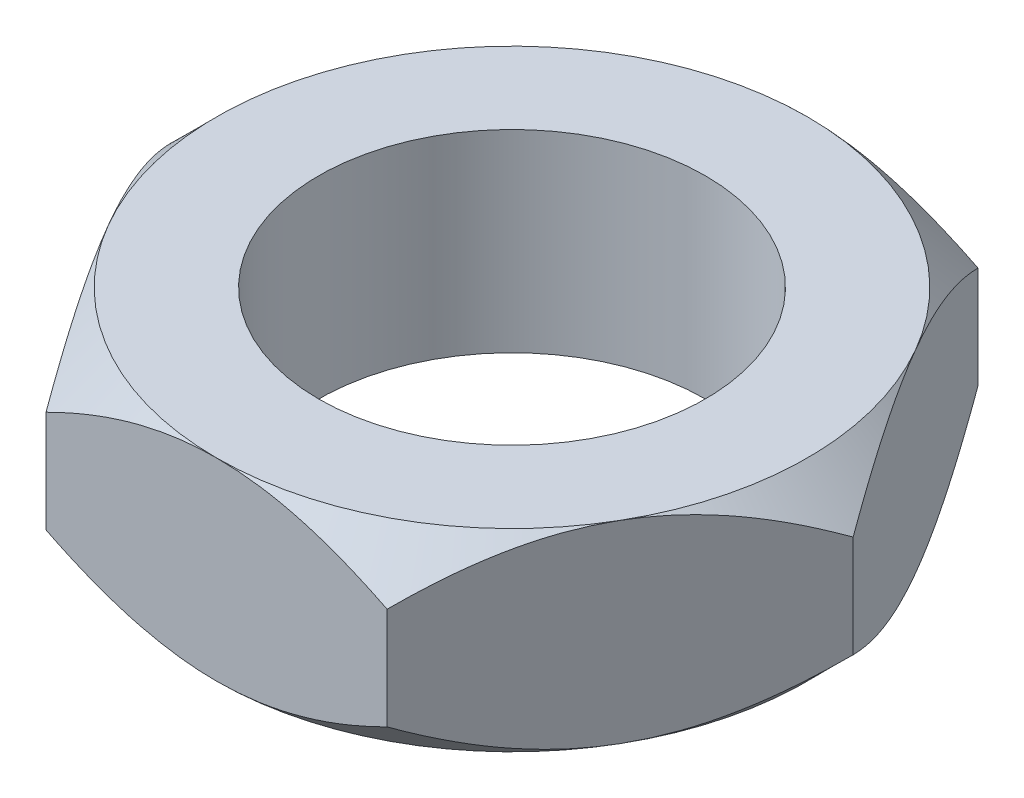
ISO-10303-21;
HEADER;
FILE_DESCRIPTION(('STEP AP214'),'2;1');
FILE_NAME('part.step','',(''),(''),'','','');
FILE_SCHEMA(('AUTOMOTIVE_DESIGN { 1 0 10303 214 1 1 1 1 }'));
ENDSEC;
DATA;
#1=APPLICATION_CONTEXT('core data for automotive mechanical design processes');
#2=APPLICATION_PROTOCOL_DEFINITION('international standard','automotive_design',2000,#1);
#3=PRODUCT_CONTEXT('',#1,'mechanical');
#4=PRODUCT('Part','Part','',(#3));
#5=PRODUCT_RELATED_PRODUCT_CATEGORY('part','',(#4));
#6=PRODUCT_DEFINITION_FORMATION('','',#4);
#7=PRODUCT_DEFINITION_CONTEXT('part definition',#1,'design');
#8=PRODUCT_DEFINITION('design','',#6,#7);
#9=PRODUCT_DEFINITION_SHAPE('','',#8);
#10=(LENGTH_UNIT() NAMED_UNIT(*) SI_UNIT(.MILLI.,.METRE.));
#11=(NAMED_UNIT(*) PLANE_ANGLE_UNIT() SI_UNIT($,.RADIAN.));
#12=(NAMED_UNIT(*) SI_UNIT($,.STERADIAN.) SOLID_ANGLE_UNIT());
#13=UNCERTAINTY_MEASURE_WITH_UNIT(LENGTH_MEASURE(1.E-05),#10,'distance_accuracy_value','');
#14=(GEOMETRIC_REPRESENTATION_CONTEXT(3) GLOBAL_UNCERTAINTY_ASSIGNED_CONTEXT((#13)) GLOBAL_UNIT_ASSIGNED_CONTEXT((#10,
#11,#12)) REPRESENTATION_CONTEXT('',''));
#15=CARTESIAN_POINT('',(0.,0.,0.));
#16=DIRECTION('',(0.,0.,1.));
#17=DIRECTION('',(1.,0.,0.));
#18=AXIS2_PLACEMENT_3D('',#15,#16,#17);
#19=CARTESIAN_POINT('',(15.8771324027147,0.,27.5));
#20=DIRECTION('',(0.,1.,0.));
#21=DIRECTION('',(0.,0.,1.));
#22=AXIS2_PLACEMENT_3D('',#19,#20,#21);
#23=PLANE('',#22);
#24=CARTESIAN_POINT('',(0.,0.,0.));
#25=DIRECTION('',(0.,1.,0.));
#26=DIRECTION('',(0.,0.,1.));
#27=AXIS2_PLACEMENT_3D('',#24,#25,#26);
#28=CIRCLE('',#27,18.);
#29=CARTESIAN_POINT('',(0.,0.,18.));
#30=VERTEX_POINT('',#29);
#31=EDGE_CURVE('E309',#30,#30,#28,.T.);
#32=ORIENTED_EDGE('',*,*,#31,.T.);
#33=EDGE_LOOP('',(#32));
#34=FACE_BOUND('',#33,.T.);
#35=CARTESIAN_POINT('',(0.,0.,0.));
#36=DIRECTION('',(0.,-1.,0.));
#37=DIRECTION('',(0.,0.,-1.));
#38=AXIS2_PLACEMENT_3D('',#35,#36,#37);
#39=CIRCLE('',#38,27.4999999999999);
#40=CARTESIAN_POINT('',(23.8156986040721,0.,13.7499999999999));
#41=VERTEX_POINT('',#40);
#42=CARTESIAN_POINT('',(0.,0.,27.5));
#43=VERTEX_POINT('',#42);
#44=EDGE_CURVE('E310',#41,#43,#39,.T.);
#45=ORIENTED_EDGE('',*,*,#44,.T.);
#46=CARTESIAN_POINT('',(-23.815698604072,0.,13.7499999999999));
#47=VERTEX_POINT('',#46);
#48=EDGE_CURVE('E167',#43,#47,#39,.T.);
#49=ORIENTED_EDGE('',*,*,#48,.T.);
#50=CARTESIAN_POINT('',(-23.8156986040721,0.,-13.75));
#51=VERTEX_POINT('',#50);
#52=EDGE_CURVE('E335',#47,#51,#39,.T.);
#53=ORIENTED_EDGE('',*,*,#52,.T.);
#54=CARTESIAN_POINT('',(0.,0.,-27.5));
#55=VERTEX_POINT('',#54);
#56=EDGE_CURVE('E336',#51,#55,#39,.T.);
#57=ORIENTED_EDGE('',*,*,#56,.T.);
#58=CARTESIAN_POINT('',(23.815698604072,0.,-13.75));
#59=VERTEX_POINT('',#58);
#60=EDGE_CURVE('E164',#55,#59,#39,.T.);
#61=ORIENTED_EDGE('',*,*,#60,.T.);
#62=EDGE_CURVE('E312',#59,#41,#39,.T.);
#63=ORIENTED_EDGE('',*,*,#62,.T.);
#64=EDGE_LOOP('',(#45,#49,#53,#57,#61,#63));
#65=FACE_BOUND('',#64,.T.);
#66=ADVANCED_FACE('F50',(#34,#65),#23,.F.);
#67=CARTESIAN_POINT('',(15.8771324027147,18.,27.5));
#68=DIRECTION('',(0.,1.,0.));
#69=DIRECTION('',(0.,0.,1.));
#70=AXIS2_PLACEMENT_3D('',#67,#68,#69);
#71=PLANE('',#70);
#72=CARTESIAN_POINT('',(0.,18.,0.));
#73=DIRECTION('',(0.,1.,0.));
#74=DIRECTION('',(0.,0.,1.));
#75=AXIS2_PLACEMENT_3D('',#72,#73,#74);
#76=CIRCLE('',#75,18.);
#77=CARTESIAN_POINT('',(0.,18.,18.));
#78=VERTEX_POINT('',#77);
#79=EDGE_CURVE('E315',#78,#78,#76,.T.);
#80=ORIENTED_EDGE('',*,*,#79,.F.);
#81=EDGE_LOOP('',(#80));
#82=FACE_BOUND('',#81,.T.);
#83=CARTESIAN_POINT('',(0.,18.,0.));
#84=DIRECTION('',(0.,1.,0.));
#85=DIRECTION('',(0.,0.,1.));
#86=AXIS2_PLACEMENT_3D('',#83,#84,#85);
#87=CIRCLE('',#86,27.4999999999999);
#88=CARTESIAN_POINT('',(-23.8156986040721,18.,13.7499999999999));
#89=VERTEX_POINT('',#88);
#90=CARTESIAN_POINT('',(0.,18.,27.5));
#91=VERTEX_POINT('',#90);
#92=EDGE_CURVE('E263',#89,#91,#87,.T.);
#93=ORIENTED_EDGE('',*,*,#92,.T.);
#94=CARTESIAN_POINT('',(23.8156986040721,18.,13.7499999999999));
#95=VERTEX_POINT('',#94);
#96=EDGE_CURVE('E260',#91,#95,#87,.T.);
#97=ORIENTED_EDGE('',*,*,#96,.T.);
#98=CARTESIAN_POINT('',(23.815698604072,18.,-13.75));
#99=VERTEX_POINT('',#98);
#100=EDGE_CURVE('E262',#95,#99,#87,.T.);
#101=ORIENTED_EDGE('',*,*,#100,.T.);
#102=CARTESIAN_POINT('',(0.,18.,-27.5));
#103=VERTEX_POINT('',#102);
#104=EDGE_CURVE('E269',#99,#103,#87,.T.);
#105=ORIENTED_EDGE('',*,*,#104,.T.);
#106=CARTESIAN_POINT('',(-23.8156986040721,18.,-13.7499999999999));
#107=VERTEX_POINT('',#106);
#108=EDGE_CURVE('E272',#103,#107,#87,.T.);
#109=ORIENTED_EDGE('',*,*,#108,.T.);
#110=EDGE_CURVE('E270',#107,#89,#87,.T.);
#111=ORIENTED_EDGE('',*,*,#110,.T.);
#112=EDGE_LOOP('',(#93,#97,#101,#105,#109,#111));
#113=FACE_BOUND('',#112,.T.);
#114=ADVANCED_FACE('F300',(#82,#113),#71,.T.);
#115=CARTESIAN_POINT('',(31.7542648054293,18.,0.));
#116=DIRECTION('',(0.866025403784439,0.,0.499999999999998));
#117=DIRECTION('',(0.499999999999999,0.,-0.86602540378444));
#118=AXIS2_PLACEMENT_3D('',#115,#116,#117);
#119=PLANE('',#118);
#120=DIRECTION('',(0.,-1.,0.));
#121=VECTOR('',#120,1.);
#122=CARTESIAN_POINT('',(15.8771324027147,18.,27.5));
#123=LINE('',#122,#121);
#124=CARTESIAN_POINT('',(15.8771324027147,13.7457351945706,27.5));
#125=VERTEX_POINT('',#124);
#126=CARTESIAN_POINT('',(15.8771324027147,4.25426480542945,27.5));
#127=VERTEX_POINT('',#126);
#128=EDGE_CURVE('E156',#125,#127,#123,.T.);
#129=ORIENTED_EDGE('',*,*,#128,.T.);
#130=CARTESIAN_POINT('',(15.8770169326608,4.25438027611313,27.5002));
#131=CARTESIAN_POINT('',(16.1499751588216,3.98146617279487,27.0274224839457));
#132=CARTESIAN_POINT('',(16.4250710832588,3.7168801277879,26.5509423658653));
#133=CARTESIAN_POINT('',(16.9798709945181,3.20700945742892,25.5900007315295));
#134=CARTESIAN_POINT('',(17.2595773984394,2.96173537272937,25.1055350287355));
#135=CARTESIAN_POINT('',(17.8252501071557,2.49209526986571,24.1257611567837));
#136=CARTESIAN_POINT('',(18.1112430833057,2.26785699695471,23.630406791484));
#137=CARTESIAN_POINT('',(18.6879264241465,1.8451587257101,22.6315619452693));
#138=CARTESIAN_POINT('',(18.9786160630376,1.64669478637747,22.1280727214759));
#139=CARTESIAN_POINT('',(19.5599955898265,1.2818380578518,21.1210938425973));
#140=CARTESIAN_POINT('',(19.8506136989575,1.11499032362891,20.6177285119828));
#141=CARTESIAN_POINT('',(20.4359720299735,0.812902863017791,19.6038581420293));
#142=CARTESIAN_POINT('',(20.7307124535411,0.677664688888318,19.0933527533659));
#143=CARTESIAN_POINT('',(21.3229741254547,0.442237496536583,18.0675254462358));
#144=CARTESIAN_POINT('',(21.6204872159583,0.341966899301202,17.5522176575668));
#145=CARTESIAN_POINT('',(22.2180483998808,0.178688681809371,16.517211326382));
#146=CARTESIAN_POINT('',(22.5180961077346,0.115675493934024,15.9975134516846));
#147=CARTESIAN_POINT('',(23.0340423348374,0.0410497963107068,15.103868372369));
#148=CARTESIAN_POINT('',(23.2496067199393,0.0199161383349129,14.7304999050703));
#149=CARTESIAN_POINT('',(23.6809913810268,-0.00206015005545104,13.9833197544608));
#150=CARTESIAN_POINT('',(23.896811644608,-0.00290372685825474,13.6095080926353));
#151=CARTESIAN_POINT('',(24.3283080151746,0.0157206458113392,12.8621344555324));
#152=CARTESIAN_POINT('',(24.543984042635,0.0351958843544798,12.4885726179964));
#153=CARTESIAN_POINT('',(24.9746510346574,0.0941671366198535,11.7426355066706));
#154=CARTESIAN_POINT('',(25.1896419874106,0.133663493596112,11.3702602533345));
#155=CARTESIAN_POINT('',(25.618726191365,0.232143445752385,10.6270646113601));
#156=CARTESIAN_POINT('',(25.8328183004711,0.291146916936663,10.2562462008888));
#157=CARTESIAN_POINT('',(26.259517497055,0.42778965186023,9.51718151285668));
#158=CARTESIAN_POINT('',(26.4721244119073,0.50543104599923,9.14893553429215));
#159=CARTESIAN_POINT('',(27.1071409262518,0.764789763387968,8.04905466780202));
#160=CARTESIAN_POINT('',(27.5269062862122,0.972979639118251,7.32199973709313));
#161=CARTESIAN_POINT('',(28.2719601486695,1.40126426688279,6.03152859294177));
#162=CARTESIAN_POINT('',(28.5989127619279,1.61009060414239,5.46523005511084));
#163=CARTESIAN_POINT('',(29.246958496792,2.06138390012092,4.34278191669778));
#164=CARTESIAN_POINT('',(29.5680514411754,2.30385187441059,3.78663262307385));
#165=CARTESIAN_POINT('',(30.2033672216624,2.81703036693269,2.68623341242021));
#166=CARTESIAN_POINT('',(30.5176080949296,3.087652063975,2.14195225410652));
#167=CARTESIAN_POINT('',(30.9846291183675,3.5120531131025,1.33304811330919));
#168=CARTESIAN_POINT('',(31.1395389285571,3.65655746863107,1.06473645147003));
#169=CARTESIAN_POINT('',(31.4479789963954,3.9512869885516,0.530502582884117));
#170=CARTESIAN_POINT('',(31.6015093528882,4.10151173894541,0.264580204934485));
#171=CARTESIAN_POINT('',(31.7543802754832,4.25438027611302,-0.000200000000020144));
#172=B_SPLINE_CURVE_WITH_KNOTS('',3,(#130,#131,#132,#133,#134,#135,#136,#137,#138,#139,#140,
#141,#142,#143,#144,#145,#146,#147,#148,#149,#150,#151,#152,#153,#154,#155,#156,#157,#158,#159,
#160,#161,#162,#163,#164,#165,#166,#167,#168,#169,#170,#171),.UNSPECIFIED.,.F.,.F.,(4,2,2,2,2,2,
2,2,2,2,2,2,2,2,2,2,2,2,2,2,4),(0.,1.83107785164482,3.66314829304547,5.50570792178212,
7.34798548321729,9.16131451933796,10.9747325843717,12.7838912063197,14.5927794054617,
15.8872763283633,17.181712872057,18.4766139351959,19.7715371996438,21.0677839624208,
22.3641789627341,24.9560053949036,27.0144129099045,29.0728825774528,31.125044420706,
32.1505818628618,33.1760452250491),.UNSPECIFIED.);
#173=EDGE_CURVE('E163',#127,#41,#172,.T.);
#174=ORIENTED_EDGE('',*,*,#173,.T.);
#175=CARTESIAN_POINT('',(31.7542648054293,4.25426480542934,0.));
#176=VERTEX_POINT('',#175);
#177=EDGE_CURVE('E70',#41,#176,#172,.T.);
#178=ORIENTED_EDGE('',*,*,#177,.T.);
#179=DIRECTION('',(0.,-1.,0.));
#180=VECTOR('',#179,1.);
#181=CARTESIAN_POINT('',(31.7542648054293,18.,0.));
#182=LINE('',#181,#180);
#183=CARTESIAN_POINT('',(31.7542648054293,13.7457351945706,0.));
#184=VERTEX_POINT('',#183);
#185=EDGE_CURVE('E171',#184,#176,#182,.T.);
#186=ORIENTED_EDGE('',*,*,#185,.F.);
#187=CARTESIAN_POINT('',(31.7543802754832,13.7456197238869,-0.00020000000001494));
#188=CARTESIAN_POINT('',(31.4814220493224,14.0185338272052,0.472577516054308));
#189=CARTESIAN_POINT('',(31.2063261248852,14.2831198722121,0.949057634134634));
#190=CARTESIAN_POINT('',(30.6515262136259,14.7929905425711,1.90999926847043));
#191=CARTESIAN_POINT('',(30.3718198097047,15.0382646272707,2.39446497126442));
#192=CARTESIAN_POINT('',(29.8061471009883,15.5079047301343,3.37423884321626));
#193=CARTESIAN_POINT('',(29.5201541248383,15.7321430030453,3.86959320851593));
#194=CARTESIAN_POINT('',(28.9434707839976,16.1548412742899,4.86843805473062));
#195=CARTESIAN_POINT('',(28.6527811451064,16.3533052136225,5.37192727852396));
#196=CARTESIAN_POINT('',(28.0714016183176,16.7181619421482,6.37890615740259));
#197=CARTESIAN_POINT('',(27.7807835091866,16.8850096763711,6.88227148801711));
#198=CARTESIAN_POINT('',(27.1954251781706,17.1870971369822,7.89614185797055));
#199=CARTESIAN_POINT('',(26.900684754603,17.3223353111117,8.40664724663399));
#200=CARTESIAN_POINT('',(26.3084230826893,17.5577625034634,9.43247455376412));
#201=CARTESIAN_POINT('',(26.0109099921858,17.6580331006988,9.94778234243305));
#202=CARTESIAN_POINT('',(25.4133488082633,17.8213113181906,10.9827886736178));
#203=CARTESIAN_POINT('',(25.1133011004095,17.8843245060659,11.5024865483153));
#204=CARTESIAN_POINT('',(24.5973548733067,17.9589502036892,12.3961316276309));
#205=CARTESIAN_POINT('',(24.3817904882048,17.9800838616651,12.7695000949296));
#206=CARTESIAN_POINT('',(23.9504058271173,18.0020601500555,13.5166802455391));
#207=CARTESIAN_POINT('',(23.7345855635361,18.0029037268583,13.8904919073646));
#208=CARTESIAN_POINT('',(23.3030891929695,17.9842793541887,14.6378655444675));
#209=CARTESIAN_POINT('',(23.0874131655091,17.9648041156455,15.0114273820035));
#210=CARTESIAN_POINT('',(22.6567461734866,17.9058328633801,15.7573644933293));
#211=CARTESIAN_POINT('',(22.4417552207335,17.8663365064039,16.1297397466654));
#212=CARTESIAN_POINT('',(22.012671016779,17.7678565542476,16.8729353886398));
#213=CARTESIAN_POINT('',(21.7985789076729,17.7088530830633,17.2437537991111));
#214=CARTESIAN_POINT('',(21.3718797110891,17.5722103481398,17.9828184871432));
#215=CARTESIAN_POINT('',(21.1592727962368,17.4945689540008,18.3510644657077));
#216=CARTESIAN_POINT('',(20.5242562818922,17.235210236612,19.4509453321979));
#217=CARTESIAN_POINT('',(20.1044909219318,17.0270203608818,20.1780002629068));
#218=CARTESIAN_POINT('',(19.3594370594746,16.5987357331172,21.4684714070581));
#219=CARTESIAN_POINT('',(19.0324844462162,16.3899093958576,22.0347699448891));
#220=CARTESIAN_POINT('',(18.384438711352,15.938616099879,23.1572180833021));
#221=CARTESIAN_POINT('',(18.0633457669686,15.6961481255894,23.7133673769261));
#222=CARTESIAN_POINT('',(17.4280299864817,15.1829696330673,24.8137665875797));
#223=CARTESIAN_POINT('',(17.1137891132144,14.912347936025,25.3580477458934));
#224=CARTESIAN_POINT('',(16.6467680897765,14.4879468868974,26.1669518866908));
#225=CARTESIAN_POINT('',(16.4918582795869,14.3434425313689,26.4352635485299));
#226=CARTESIAN_POINT('',(16.1834182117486,14.0487130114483,26.9694974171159));
#227=CARTESIAN_POINT('',(16.0298878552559,13.8984882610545,27.2354197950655));
#228=CARTESIAN_POINT('',(15.8770169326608,13.7456197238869,27.5002));
#229=B_SPLINE_CURVE_WITH_KNOTS('',3,(#187,#188,#189,#190,#191,#192,#193,#194,#195,#196,#197,
#198,#199,#200,#201,#202,#203,#204,#205,#206,#207,#208,#209,#210,#211,#212,#213,#214,#215,#216,
#217,#218,#219,#220,#221,#222,#223,#224,#225,#226,#227,#228),.UNSPECIFIED.,.F.,.F.,(4,2,2,2,2,2,
2,2,2,2,2,2,2,2,2,2,2,2,2,2,4),(0.,1.83107785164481,3.66314829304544,5.50570792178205,
7.34798548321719,9.16131451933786,10.9747325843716,12.7838912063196,14.5927794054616,
15.8872763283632,17.1817128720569,18.4766139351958,19.7715371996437,21.0677839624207,
22.364178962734,24.9560053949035,27.0144129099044,29.0728825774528,31.125044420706,
32.1505818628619,33.1760452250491),.UNSPECIFIED.);
#230=EDGE_CURVE('E349',#184,#95,#229,.T.);
#231=ORIENTED_EDGE('',*,*,#230,.T.);
#232=EDGE_CURVE('E210',#95,#125,#229,.T.);
#233=ORIENTED_EDGE('',*,*,#232,.T.);
#234=EDGE_LOOP('',(#129,#174,#178,#186,#231,#233));
#235=FACE_BOUND('',#234,.T.);
#236=ADVANCED_FACE('F52',(#235),#119,.T.);
#237=CARTESIAN_POINT('',(31.7542648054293,18.,0.));
#238=DIRECTION('',(-0.86602540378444,0.,0.499999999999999));
#239=DIRECTION('',(0.499999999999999,0.,0.86602540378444));
#240=AXIS2_PLACEMENT_3D('',#237,#238,#239);
#241=PLANE('',#240);
#242=CARTESIAN_POINT('',(15.8770169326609,4.25438027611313,-27.5002));
#243=CARTESIAN_POINT('',(16.1499751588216,3.98146617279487,-27.0274224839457));
#244=CARTESIAN_POINT('',(16.4250710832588,3.7168801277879,-26.5509423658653));
#245=CARTESIAN_POINT('',(16.9798709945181,3.20700945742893,-25.5900007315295));
#246=CARTESIAN_POINT('',(17.2595773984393,2.96173537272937,-25.1055350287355));
#247=CARTESIAN_POINT('',(17.8252501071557,2.49209526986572,-24.1257611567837));
#248=CARTESIAN_POINT('',(18.1112430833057,2.26785699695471,-23.630406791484));
#249=CARTESIAN_POINT('',(18.6879264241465,1.84515872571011,-22.6315619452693));
#250=CARTESIAN_POINT('',(18.9786160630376,1.64669478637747,-22.128072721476));
#251=CARTESIAN_POINT('',(19.5599955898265,1.28183805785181,-21.1210938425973));
#252=CARTESIAN_POINT('',(19.8506136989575,1.11499032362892,-20.6177285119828));
#253=CARTESIAN_POINT('',(20.4359720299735,0.812902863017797,-19.6038581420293));
#254=CARTESIAN_POINT('',(20.7307124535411,0.677664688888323,-19.0933527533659));
#255=CARTESIAN_POINT('',(21.3229741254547,0.44223749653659,-18.0675254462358));
#256=CARTESIAN_POINT('',(21.6204872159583,0.341966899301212,-17.5522176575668));
#257=CARTESIAN_POINT('',(22.2180483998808,0.178688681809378,-16.517211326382));
#258=CARTESIAN_POINT('',(22.5180961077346,0.115675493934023,-15.9975134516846));
#259=CARTESIAN_POINT('',(23.0340423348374,0.0410497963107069,-15.103868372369));
#260=CARTESIAN_POINT('',(23.2496067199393,0.019916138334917,-14.7304999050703));
#261=CARTESIAN_POINT('',(23.6809913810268,-0.00206015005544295,-13.9833197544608));
#262=CARTESIAN_POINT('',(23.896811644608,-0.00290372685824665,-13.6095080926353));
#263=CARTESIAN_POINT('',(24.3283080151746,0.0157206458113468,-12.8621344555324));
#264=CARTESIAN_POINT('',(24.543984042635,0.0351958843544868,-12.4885726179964));
#265=CARTESIAN_POINT('',(24.9746510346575,0.0941671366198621,-11.7426355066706));
#266=CARTESIAN_POINT('',(25.1896419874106,0.133663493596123,-11.3702602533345));
#267=CARTESIAN_POINT('',(25.6187261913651,0.232143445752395,-10.6270646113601));
#268=CARTESIAN_POINT('',(25.8328183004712,0.29114691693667,-10.2562462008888));
#269=CARTESIAN_POINT('',(26.259517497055,0.427789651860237,-9.51718151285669));
#270=CARTESIAN_POINT('',(26.4721244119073,0.50543104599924,-9.14893553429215));
#271=CARTESIAN_POINT('',(27.1071409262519,0.764789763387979,-8.04905466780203));
#272=CARTESIAN_POINT('',(27.5269062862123,0.97297963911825,-7.32199973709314));
#273=CARTESIAN_POINT('',(28.2719601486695,1.40126426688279,-6.03152859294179));
#274=CARTESIAN_POINT('',(28.5989127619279,1.61009060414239,-5.46523005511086));
#275=CARTESIAN_POINT('',(29.246958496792,2.06138390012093,-4.3427819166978));
#276=CARTESIAN_POINT('',(29.5680514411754,2.3038518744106,-3.78663262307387));
#277=CARTESIAN_POINT('',(30.2033672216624,2.81703036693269,-2.68623341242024));
#278=CARTESIAN_POINT('',(30.5176080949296,3.087652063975,-2.14195225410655));
#279=CARTESIAN_POINT('',(30.9846291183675,3.5120531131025,-1.33304811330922));
#280=CARTESIAN_POINT('',(31.1395389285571,3.65655746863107,-1.06473645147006));
#281=CARTESIAN_POINT('',(31.4479789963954,3.9512869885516,-0.530502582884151));
#282=CARTESIAN_POINT('',(31.6015093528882,4.10151173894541,-0.264580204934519));
#283=CARTESIAN_POINT('',(31.7543802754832,4.25438027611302,0.000199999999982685));
#284=B_SPLINE_CURVE_WITH_KNOTS('',3,(#242,#243,#244,#245,#246,#247,#248,#249,#250,#251,#252,
#253,#254,#255,#256,#257,#258,#259,#260,#261,#262,#263,#264,#265,#266,#267,#268,#269,#270,#271,
#272,#273,#274,#275,#276,#277,#278,#279,#280,#281,#282,#283),.UNSPECIFIED.,.F.,.F.,(4,2,2,2,2,2,
2,2,2,2,2,2,2,2,2,2,2,2,2,2,4),(0.,1.83107785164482,3.66314829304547,5.50570792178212,
7.34798548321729,9.16131451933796,10.9747325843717,12.7838912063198,14.5927794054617,
15.8872763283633,17.181712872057,18.4766139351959,19.7715371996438,21.0677839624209,
22.3641789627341,24.9560053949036,27.0144129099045,29.0728825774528,31.125044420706,
32.1505818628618,33.1760452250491),.UNSPECIFIED.);
#285=CARTESIAN_POINT('',(15.8771324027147,4.25426480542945,-27.5));
#286=VERTEX_POINT('',#285);
#287=EDGE_CURVE('E254',#286,#59,#284,.T.);
#288=ORIENTED_EDGE('',*,*,#287,.F.);
#289=DIRECTION('',(0.,-1.,0.));
#290=VECTOR('',#289,1.);
#291=CARTESIAN_POINT('',(15.8771324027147,18.,-27.5));
#292=LINE('',#291,#290);
#293=CARTESIAN_POINT('',(15.8771324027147,13.7457351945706,-27.5));
#294=VERTEX_POINT('',#293);
#295=EDGE_CURVE('E323',#294,#286,#292,.T.);
#296=ORIENTED_EDGE('',*,*,#295,.F.);
#297=CARTESIAN_POINT('',(31.7543802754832,13.7456197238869,0.000199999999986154));
#298=CARTESIAN_POINT('',(31.4814220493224,14.0185338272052,-0.472577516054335));
#299=CARTESIAN_POINT('',(31.2063261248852,14.2831198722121,-0.94905763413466));
#300=CARTESIAN_POINT('',(30.6515262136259,14.7929905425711,-1.90999926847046));
#301=CARTESIAN_POINT('',(30.3718198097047,15.0382646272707,-2.39446497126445));
#302=CARTESIAN_POINT('',(29.8061471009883,15.5079047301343,-3.37423884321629));
#303=CARTESIAN_POINT('',(29.5201541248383,15.7321430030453,-3.86959320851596));
#304=CARTESIAN_POINT('',(28.9434707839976,16.1548412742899,-4.86843805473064));
#305=CARTESIAN_POINT('',(28.6527811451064,16.3533052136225,-5.37192727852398));
#306=CARTESIAN_POINT('',(28.0714016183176,16.7181619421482,-6.37890615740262));
#307=CARTESIAN_POINT('',(27.7807835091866,16.8850096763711,-6.88227148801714));
#308=CARTESIAN_POINT('',(27.1954251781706,17.1870971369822,-7.89614185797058));
#309=CARTESIAN_POINT('',(26.900684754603,17.3223353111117,-8.40664724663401));
#310=CARTESIAN_POINT('',(26.3084230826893,17.5577625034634,-9.43247455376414));
#311=CARTESIAN_POINT('',(26.0109099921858,17.6580331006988,-9.94778234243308));
#312=CARTESIAN_POINT('',(25.4133488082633,17.8213113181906,-10.9827886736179));
#313=CARTESIAN_POINT('',(25.1133011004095,17.8843245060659,-11.5024865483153));
#314=CARTESIAN_POINT('',(24.5973548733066,17.9589502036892,-12.3961316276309));
#315=CARTESIAN_POINT('',(24.3817904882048,17.9800838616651,-12.7695000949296));
#316=CARTESIAN_POINT('',(23.9504058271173,18.0020601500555,-13.5166802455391));
#317=CARTESIAN_POINT('',(23.7345855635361,18.0029037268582,-13.8904919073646));
#318=CARTESIAN_POINT('',(23.3030891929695,17.9842793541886,-14.6378655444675));
#319=CARTESIAN_POINT('',(23.0874131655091,17.9648041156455,-15.0114273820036));
#320=CARTESIAN_POINT('',(22.6567461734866,17.9058328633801,-15.7573644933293));
#321=CARTESIAN_POINT('',(22.4417552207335,17.8663365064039,-16.1297397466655));
#322=CARTESIAN_POINT('',(22.012671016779,17.7678565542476,-16.8729353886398));
#323=CARTESIAN_POINT('',(21.7985789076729,17.7088530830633,-17.2437537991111));
#324=CARTESIAN_POINT('',(21.3718797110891,17.5722103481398,-17.9828184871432));
#325=CARTESIAN_POINT('',(21.1592727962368,17.4945689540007,-18.3510644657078));
#326=CARTESIAN_POINT('',(20.5242562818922,17.235210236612,-19.4509453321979));
#327=CARTESIAN_POINT('',(20.1044909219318,17.0270203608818,-20.1780002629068));
#328=CARTESIAN_POINT('',(19.3594370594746,16.5987357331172,-21.4684714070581));
#329=CARTESIAN_POINT('',(19.0324844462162,16.3899093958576,-22.0347699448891));
#330=CARTESIAN_POINT('',(18.384438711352,15.938616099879,-23.1572180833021));
#331=CARTESIAN_POINT('',(18.0633457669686,15.6961481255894,-23.7133673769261));
#332=CARTESIAN_POINT('',(17.4280299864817,15.1829696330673,-24.8137665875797));
#333=CARTESIAN_POINT('',(17.1137891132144,14.912347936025,-25.3580477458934));
#334=CARTESIAN_POINT('',(16.6467680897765,14.4879468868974,-26.1669518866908));
#335=CARTESIAN_POINT('',(16.4918582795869,14.3434425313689,-26.43526354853));
#336=CARTESIAN_POINT('',(16.1834182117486,14.0487130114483,-26.9694974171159));
#337=CARTESIAN_POINT('',(16.0298878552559,13.8984882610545,-27.2354197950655));
#338=CARTESIAN_POINT('',(15.8770169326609,13.7456197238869,-27.5002));
#339=B_SPLINE_CURVE_WITH_KNOTS('',3,(#297,#298,#299,#300,#301,#302,#303,#304,#305,#306,#307,
#308,#309,#310,#311,#312,#313,#314,#315,#316,#317,#318,#319,#320,#321,#322,#323,#324,#325,#326,
#327,#328,#329,#330,#331,#332,#333,#334,#335,#336,#337,#338),.UNSPECIFIED.,.F.,.F.,(4,2,2,2,2,2,
2,2,2,2,2,2,2,2,2,2,2,2,2,2,4),(0.,1.8310778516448,3.66314829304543,5.50570792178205,
7.34798548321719,9.16131451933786,10.9747325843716,12.7838912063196,14.5927794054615,
15.8872763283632,17.1817128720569,18.4766139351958,19.7715371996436,21.0677839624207,
22.364178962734,24.9560053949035,27.0144129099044,29.0728825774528,31.125044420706,
32.1505818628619,33.1760452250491),.UNSPECIFIED.);
#340=EDGE_CURVE('E319',#99,#294,#339,.T.);
#341=ORIENTED_EDGE('',*,*,#340,.F.);
#342=EDGE_CURVE('E221',#184,#99,#339,.T.);
#343=ORIENTED_EDGE('',*,*,#342,.F.);
#344=ORIENTED_EDGE('',*,*,#185,.T.);
#345=EDGE_CURVE('E259',#59,#176,#284,.T.);
#346=ORIENTED_EDGE('',*,*,#345,.F.);
#347=EDGE_LOOP('',(#288,#296,#341,#343,#344,#346));
#348=FACE_BOUND('',#347,.T.);
#349=ADVANCED_FACE('F233',(#348),#241,.F.);
#350=CARTESIAN_POINT('',(-15.8771324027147,18.,-27.5));
#351=DIRECTION('',(0.,0.,-1.));
#352=DIRECTION('',(-1.,0.,0.));
#353=AXIS2_PLACEMENT_3D('',#350,#351,#352);
#354=PLANE('',#353);
#355=ORIENTED_EDGE('',*,*,#295,.T.);
#356=CARTESIAN_POINT('',(-40.0216501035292,21.0590617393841,-27.5));
#357=CARTESIAN_POINT('',(-39.5180259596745,20.6439931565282,-27.5));
#358=CARTESIAN_POINT('',(-39.0131772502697,20.2304067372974,-27.5));
#359=CARTESIAN_POINT('',(-38.0007843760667,19.4065325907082,-27.5));
#360=CARTESIAN_POINT('',(-37.4932401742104,18.9962449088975,-27.5));
#361=CARTESIAN_POINT('',(-36.4750971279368,18.1792123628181,-27.5));
#362=CARTESIAN_POINT('',(-35.9644975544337,17.7724684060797,-27.5));
#363=CARTESIAN_POINT('',(-34.9400970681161,16.9630403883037,-27.5));
#364=CARTESIAN_POINT('',(-34.4262961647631,16.5603563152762,-27.5));
#365=CARTESIAN_POINT('',(-32.8682549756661,15.3502027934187,-27.5));
#366=CARTESIAN_POINT('',(-31.8185943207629,14.5496653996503,-27.5));
#367=CARTESIAN_POINT('',(-30.231206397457,13.3662697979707,-27.5));
#368=CARTESIAN_POINT('',(-29.699947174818,12.9747202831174,-27.5));
#369=CARTESIAN_POINT('',(-28.6326626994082,12.1981764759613,-27.5));
#370=CARTESIAN_POINT('',(-28.0966375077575,11.8131820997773,-27.5));
#371=CARTESIAN_POINT('',(-26.967424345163,11.0138669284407,-27.5));
#372=CARTESIAN_POINT('',(-26.3737054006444,10.6002951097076,-27.5));
#373=CARTESIAN_POINT('',(-25.1792270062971,9.78342222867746,-27.5));
#374=CARTESIAN_POINT('',(-24.5784675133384,9.38012122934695,-27.5));
#375=CARTESIAN_POINT('',(-23.3688914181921,8.58527624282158,-27.5));
#376=CARTESIAN_POINT('',(-22.7600719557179,8.19373659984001,-27.5));
#377=CARTESIAN_POINT('',(-21.5337192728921,7.42453257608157,-27.5));
#378=CARTESIAN_POINT('',(-20.9161861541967,7.04686803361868,-27.5));
#379=CARTESIAN_POINT('',(-19.6743475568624,6.30948808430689,-27.5));
#380=CARTESIAN_POINT('',(-19.0500868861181,5.94969742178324,-27.5));
#381=CARTESIAN_POINT('',(-17.7909871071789,5.24897879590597,-27.5));
#382=CARTESIAN_POINT('',(-17.1561474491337,4.90805181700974,-27.5));
#383=CARTESIAN_POINT('',(-15.8754503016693,4.24868165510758,-27.5));
#384=CARTESIAN_POINT('',(-15.2296013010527,3.93022204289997,-27.5));
#385=CARTESIAN_POINT('',(-13.9256797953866,3.31952025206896,-27.5));
#386=CARTESIAN_POINT('',(-13.267609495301,3.0272733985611,-27.5000000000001));
#387=CARTESIAN_POINT('',(-12.134656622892,2.555259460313,-27.5));
#388=CARTESIAN_POINT('',(-11.6629999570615,2.36774295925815,-27.5));
#389=CARTESIAN_POINT('',(-10.7132136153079,2.00981958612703,-27.5));
#390=CARTESIAN_POINT('',(-10.2350839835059,1.83941259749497,-27.5));
#391=CARTESIAN_POINT('',(-9.27232541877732,1.51758374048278,-27.5));
#392=CARTESIAN_POINT('',(-8.78769493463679,1.36616649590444,-27.5));
#393=CARTESIAN_POINT('',(-7.81236796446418,1.08435211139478,-27.5));
#394=CARTESIAN_POINT('',(-7.32167189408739,0.953953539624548,-27.5));
#395=CARTESIAN_POINT('',(-6.34583681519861,0.718797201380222,-27.5));
#396=CARTESIAN_POINT('',(-5.86082152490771,0.613528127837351,-27.5));
#397=CARTESIAN_POINT('',(-4.88623758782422,0.426629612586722,-27.5));
#398=CARTESIAN_POINT('',(-4.39666897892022,0.344999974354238,-27.5));
#399=CARTESIAN_POINT('',(-3.41407349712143,0.206846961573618,-27.5));
#400=CARTESIAN_POINT('',(-2.92104726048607,0.150319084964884,-27.5));
#401=CARTESIAN_POINT('',(-1.93268710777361,0.0634358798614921,-27.5));
#402=CARTESIAN_POINT('',(-1.43735323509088,0.0330800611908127,-27.5));
#403=CARTESIAN_POINT('',(-0.472669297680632,6.87414029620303E-05,-27.5));
#404=CARTESIAN_POINT('',(-0.00336727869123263,-0.00400004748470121,-27.5));
#405=CARTESIAN_POINT('',(0.934823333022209,0.0118868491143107,-27.5));
#406=CARTESIAN_POINT('',(1.4037119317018,0.0318421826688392,-27.5));
#407=CARTESIAN_POINT('',(2.33989375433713,0.0954158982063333,-27.5));
#408=CARTESIAN_POINT('',(2.80718690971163,0.139035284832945,-27.5));
#409=CARTESIAN_POINT('',(3.73905856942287,0.249170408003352,-27.5));
#410=CARTESIAN_POINT('',(4.20363703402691,0.315686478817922,-27.5));
#411=CARTESIAN_POINT('',(5.13805465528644,0.472010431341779,-27.5));
#412=CARTESIAN_POINT('',(5.60782268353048,0.562242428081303,-27.5));
#413=CARTESIAN_POINT('',(6.542804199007,0.763930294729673,-27.5));
#414=CARTESIAN_POINT('',(7.0080170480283,0.875389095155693,-27.5));
#415=CARTESIAN_POINT('',(8.3957004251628,1.2391969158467,-27.5));
#416=CARTESIAN_POINT('',(9.31053511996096,1.521032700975,-27.5));
#417=CARTESIAN_POINT('',(11.1344477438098,2.15602422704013,-27.5));
#418=CARTESIAN_POINT('',(12.043074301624,2.51045072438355,-27.5));
#419=CARTESIAN_POINT('',(13.8371584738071,3.27430434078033,-27.5));
#420=CARTESIAN_POINT('',(14.7226057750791,3.68375546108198,-27.5));
#421=CARTESIAN_POINT('',(16.4743318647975,4.54795265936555,-27.5));
#422=CARTESIAN_POINT('',(17.3405427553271,5.00283515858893,-27.5));
#423=CARTESIAN_POINT('',(19.0531809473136,5.94792772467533,-27.5));
#424=CARTESIAN_POINT('',(19.8996111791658,6.43813251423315,-27.5));
#425=CARTESIAN_POINT('',(21.5338188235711,7.42207375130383,-27.5));
#426=CARTESIAN_POINT('',(22.3224271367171,7.91443747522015,-27.5));
#427=CARTESIAN_POINT('',(23.8860940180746,8.92028551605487,-27.5));
#428=CARTESIAN_POINT('',(24.6611515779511,9.43377139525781,-27.5));
#429=CARTESIAN_POINT('',(26.1933122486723,10.4740150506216,-27.5));
#430=CARTESIAN_POINT('',(26.950509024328,11.0006351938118,-27.5));
#431=CARTESIAN_POINT('',(28.0785647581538,11.8012186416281,-27.5));
#432=CARTESIAN_POINT('',(28.4532460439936,12.0698203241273,-27.5));
#433=CARTESIAN_POINT('',(29.2002228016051,12.6103056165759,-27.5));
#434=CARTESIAN_POINT('',(29.5725183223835,12.8821891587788,-27.5));
#435=CARTESIAN_POINT('',(29.9437090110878,13.1555741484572,-27.5));
#436=B_SPLINE_CURVE_WITH_KNOTS('',3,(#356,#357,#358,#359,#360,#361,#362,#363,#364,#365,#366,
#367,#368,#369,#370,#371,#372,#373,#374,#375,#376,#377,#378,#379,#380,#381,#382,#383,#384,#385,
#386,#387,#388,#389,#390,#391,#392,#393,#394,#395,#396,#397,#398,#399,#400,#401,#402,#403,#404,
#405,#406,#407,#408,#409,#410,#411,#412,#413,#414,#415,#416,#417,#418,#419,#420,#421,#422,#423,
#424,#425,#426,#427,#428,#429,#430,#431,#432,#433,#434,#435),.UNSPECIFIED.,.F.,.F.,(4,2,2,2,2,2,
2,2,2,2,2,2,2,2,2,2,2,2,2,2,2,2,2,2,2,2,2,2,2,2,2,2,2,2,2,2,2,2,2,4),(0.,1.95787490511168,
3.91577679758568,5.8741661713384,7.83254975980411,11.7925213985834,13.7723630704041,
15.7521793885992,17.922775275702,20.0933844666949,22.2647857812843,24.4361617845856,
26.5974471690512,28.7588452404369,30.918646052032,33.078060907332,34.600472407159,
36.1228735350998,37.6456446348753,39.1683119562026,40.6566882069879,42.1450520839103,
43.6331489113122,45.1212178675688,46.5285661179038,47.9358937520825,49.3432811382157,
50.7506890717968,52.1852164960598,53.6199421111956,56.4884244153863,59.4122334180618,
62.3373219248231,65.271474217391,68.2051890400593,70.9938664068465,73.782750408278,
76.5495060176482,77.9325303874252,79.3155262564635),.UNSPECIFIED.);
#437=EDGE_CURVE('E247',#286,#55,#436,.F.);
#438=ORIENTED_EDGE('',*,*,#437,.T.);
#439=CARTESIAN_POINT('',(-15.8771324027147,4.25426480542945,-27.5));
#440=VERTEX_POINT('',#439);
#441=EDGE_CURVE('E240',#55,#440,#436,.F.);
#442=ORIENTED_EDGE('',*,*,#441,.T.);
#443=DIRECTION('',(0.,-1.,0.));
#444=VECTOR('',#443,1.);
#445=CARTESIAN_POINT('',(-15.8771324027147,18.,-27.5));
#446=LINE('',#445,#444);
#447=CARTESIAN_POINT('',(-15.8771324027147,13.7457351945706,-27.5));
#448=VERTEX_POINT('',#447);
#449=EDGE_CURVE('E326',#448,#440,#446,.T.);
#450=ORIENTED_EDGE('',*,*,#449,.F.);
#451=CARTESIAN_POINT('',(-40.0216501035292,-3.05906173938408,-27.5));
#452=CARTESIAN_POINT('',(-39.5180259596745,-2.64399315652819,-27.5));
#453=CARTESIAN_POINT('',(-39.0131772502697,-2.23040673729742,-27.5));
#454=CARTESIAN_POINT('',(-38.0007843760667,-1.4065325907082,-27.5));
#455=CARTESIAN_POINT('',(-37.4932401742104,-0.996244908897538,-27.5));
#456=CARTESIAN_POINT('',(-36.4750971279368,-0.179212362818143,-27.5));
#457=CARTESIAN_POINT('',(-35.9644975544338,0.227531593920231,-27.5));
#458=CARTESIAN_POINT('',(-34.9400970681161,1.0369596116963,-27.5));
#459=CARTESIAN_POINT('',(-34.4262961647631,1.4396436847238,-27.5));
#460=CARTESIAN_POINT('',(-32.8682549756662,2.64979720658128,-27.5));
#461=CARTESIAN_POINT('',(-31.818594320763,3.45033460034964,-27.5));
#462=CARTESIAN_POINT('',(-30.231206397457,4.63373020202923,-27.5));
#463=CARTESIAN_POINT('',(-29.6999471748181,5.02527971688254,-27.5));
#464=CARTESIAN_POINT('',(-28.6326626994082,5.80182352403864,-27.5));
#465=CARTESIAN_POINT('',(-28.0966375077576,6.18681790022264,-27.5));
#466=CARTESIAN_POINT('',(-26.9674243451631,6.98613307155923,-27.5));
#467=CARTESIAN_POINT('',(-26.3737054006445,7.39970489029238,-27.5));
#468=CARTESIAN_POINT('',(-25.1792270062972,8.2165777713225,-27.5));
#469=CARTESIAN_POINT('',(-24.5784675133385,8.61987877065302,-27.5));
#470=CARTESIAN_POINT('',(-23.3688914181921,9.41472375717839,-27.5));
#471=CARTESIAN_POINT('',(-22.7600719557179,9.80626340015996,-27.5));
#472=CARTESIAN_POINT('',(-21.5337192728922,10.5754674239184,-27.5));
#473=CARTESIAN_POINT('',(-20.9161861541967,10.9531319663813,-27.5));
#474=CARTESIAN_POINT('',(-19.6743475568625,11.6905119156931,-27.5));
#475=CARTESIAN_POINT('',(-19.0500868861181,12.0503025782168,-27.5));
#476=CARTESIAN_POINT('',(-17.7909871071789,12.751021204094,-27.5));
#477=CARTESIAN_POINT('',(-17.1561474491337,13.0919481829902,-27.5));
#478=CARTESIAN_POINT('',(-15.8754503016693,13.7513183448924,-27.5));
#479=CARTESIAN_POINT('',(-15.2296013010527,14.0697779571,-27.5));
#480=CARTESIAN_POINT('',(-13.9256797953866,14.680479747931,-27.5));
#481=CARTESIAN_POINT('',(-13.267609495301,14.9727266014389,-27.5000000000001));
#482=CARTESIAN_POINT('',(-12.134656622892,15.444740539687,-27.5000000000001));
#483=CARTESIAN_POINT('',(-11.6629999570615,15.6322570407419,-27.5));
#484=CARTESIAN_POINT('',(-10.7132136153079,15.990180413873,-27.5));
#485=CARTESIAN_POINT('',(-10.2350839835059,16.160587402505,-27.5));
#486=CARTESIAN_POINT('',(-9.27232541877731,16.4824162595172,-27.5));
#487=CARTESIAN_POINT('',(-8.78769493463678,16.6338335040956,-27.5));
#488=CARTESIAN_POINT('',(-7.81236796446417,16.9156478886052,-27.5));
#489=CARTESIAN_POINT('',(-7.32167189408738,17.0460464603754,-27.5));
#490=CARTESIAN_POINT('',(-6.3458368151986,17.2812027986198,-27.5));
#491=CARTESIAN_POINT('',(-5.8608215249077,17.3864718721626,-27.5));
#492=CARTESIAN_POINT('',(-4.8862375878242,17.5733703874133,-27.5));
#493=CARTESIAN_POINT('',(-4.39666897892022,17.6550000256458,-27.5));
#494=CARTESIAN_POINT('',(-3.41407349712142,17.7931530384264,-27.5));
#495=CARTESIAN_POINT('',(-2.92104726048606,17.8496809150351,-27.5));
#496=CARTESIAN_POINT('',(-1.93268710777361,17.9365641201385,-27.5));
#497=CARTESIAN_POINT('',(-1.43735323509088,17.9669199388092,-27.5));
#498=CARTESIAN_POINT('',(-0.472669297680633,17.9999312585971,-27.5));
#499=CARTESIAN_POINT('',(-0.00336727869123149,18.0040000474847,-27.5));
#500=CARTESIAN_POINT('',(0.934823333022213,17.9881131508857,-27.5));
#501=CARTESIAN_POINT('',(1.4037119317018,17.9681578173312,-27.5));
#502=CARTESIAN_POINT('',(2.33989375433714,17.9045841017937,-27.5));
#503=CARTESIAN_POINT('',(2.80718690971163,17.8609647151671,-27.5));
#504=CARTESIAN_POINT('',(3.73905856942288,17.7508295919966,-27.5));
#505=CARTESIAN_POINT('',(4.20363703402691,17.6843135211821,-27.5));
#506=CARTESIAN_POINT('',(5.13805465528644,17.5279895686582,-27.5));
#507=CARTESIAN_POINT('',(5.60782268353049,17.4377575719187,-27.5));
#508=CARTESIAN_POINT('',(6.54280419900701,17.2360697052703,-27.5));
#509=CARTESIAN_POINT('',(7.00801704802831,17.1246109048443,-27.5));
#510=CARTESIAN_POINT('',(8.3957004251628,16.7608030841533,-27.5));
#511=CARTESIAN_POINT('',(9.31053511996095,16.4789672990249,-27.5));
#512=CARTESIAN_POINT('',(11.1344477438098,15.8439757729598,-27.5));
#513=CARTESIAN_POINT('',(12.043074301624,15.4895492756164,-27.5));
#514=CARTESIAN_POINT('',(13.8371584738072,14.7256956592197,-27.5));
#515=CARTESIAN_POINT('',(14.7226057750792,14.316244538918,-27.5));
#516=CARTESIAN_POINT('',(16.4743318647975,13.4520473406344,-27.5));
#517=CARTESIAN_POINT('',(17.3405427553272,12.997164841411,-27.5));
#518=CARTESIAN_POINT('',(19.0531809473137,12.0520722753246,-27.5));
#519=CARTESIAN_POINT('',(19.8996111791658,11.5618674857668,-27.5));
#520=CARTESIAN_POINT('',(21.5338188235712,10.5779262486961,-27.5));
#521=CARTESIAN_POINT('',(22.3224271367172,10.0855625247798,-27.5));
#522=CARTESIAN_POINT('',(23.8860940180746,9.07971448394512,-27.5));
#523=CARTESIAN_POINT('',(24.6611515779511,8.56622860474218,-27.5));
#524=CARTESIAN_POINT('',(26.1933122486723,7.52598494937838,-27.5));
#525=CARTESIAN_POINT('',(26.950509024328,6.99936480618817,-27.5));
#526=CARTESIAN_POINT('',(28.0785647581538,6.19878135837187,-27.5));
#527=CARTESIAN_POINT('',(28.4532460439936,5.93017967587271,-27.5));
#528=CARTESIAN_POINT('',(29.2002228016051,5.38969438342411,-27.5));
#529=CARTESIAN_POINT('',(29.5725183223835,5.11781084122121,-27.5));
#530=CARTESIAN_POINT('',(29.9437090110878,4.84442585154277,-27.5));
#531=B_SPLINE_CURVE_WITH_KNOTS('',3,(#451,#452,#453,#454,#455,#456,#457,#458,#459,#460,#461,
#462,#463,#464,#465,#466,#467,#468,#469,#470,#471,#472,#473,#474,#475,#476,#477,#478,#479,#480,
#481,#482,#483,#484,#485,#486,#487,#488,#489,#490,#491,#492,#493,#494,#495,#496,#497,#498,#499,
#500,#501,#502,#503,#504,#505,#506,#507,#508,#509,#510,#511,#512,#513,#514,#515,#516,#517,#518,
#519,#520,#521,#522,#523,#524,#525,#526,#527,#528,#529,#530),.UNSPECIFIED.,.F.,.F.,(4,2,2,2,2,2,
2,2,2,2,2,2,2,2,2,2,2,2,2,2,2,2,2,2,2,2,2,2,2,2,2,2,2,2,2,2,2,2,2,4),(0.,1.95787490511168,
3.91577679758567,5.87416617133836,7.83254975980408,11.7925213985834,13.772363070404,
15.7521793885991,17.922775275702,20.0933844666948,22.2647857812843,24.4361617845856,
26.5974471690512,28.7588452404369,30.918646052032,33.078060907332,34.600472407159,
36.1228735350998,37.6456446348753,39.1683119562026,40.6566882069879,42.1450520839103,
43.6331489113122,45.1212178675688,46.5285661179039,47.9358937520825,49.3432811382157,
50.7506890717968,52.1852164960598,53.6199421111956,56.4884244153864,59.4122334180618,
62.3373219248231,65.2714742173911,68.2051890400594,70.9938664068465,73.782750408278,
76.5495060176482,77.9325303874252,79.3155262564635),.UNSPECIFIED.);
#532=EDGE_CURVE('E215',#448,#103,#531,.T.);
#533=ORIENTED_EDGE('',*,*,#532,.T.);
#534=EDGE_CURVE('E223',#103,#294,#531,.T.);
#535=ORIENTED_EDGE('',*,*,#534,.T.);
#536=EDGE_LOOP('',(#355,#438,#442,#450,#533,#535));
#537=FACE_BOUND('',#536,.T.);
#538=ADVANCED_FACE('F229',(#537),#354,.T.);
#539=CARTESIAN_POINT('',(-31.7542648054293,18.,0.));
#540=DIRECTION('',(-0.866025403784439,0.,-0.499999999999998));
#541=DIRECTION('',(-0.499999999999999,0.,0.86602540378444));
#542=AXIS2_PLACEMENT_3D('',#539,#540,#541);
#543=PLANE('',#542);
#544=ORIENTED_EDGE('',*,*,#449,.T.);
#545=CARTESIAN_POINT('',(-15.8770169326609,4.25438027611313,-27.5002000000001));
#546=CARTESIAN_POINT('',(-16.1499751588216,3.98146617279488,-27.0274224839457));
#547=CARTESIAN_POINT('',(-16.4250710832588,3.71688012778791,-26.5509423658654));
#548=CARTESIAN_POINT('',(-16.9798709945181,3.20700945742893,-25.5900007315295));
#549=CARTESIAN_POINT('',(-17.2595773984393,2.96173537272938,-25.1055350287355));
#550=CARTESIAN_POINT('',(-17.8252501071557,2.49209526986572,-24.1257611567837));
#551=CARTESIAN_POINT('',(-18.1112430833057,2.26785699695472,-23.630406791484));
#552=CARTESIAN_POINT('',(-18.6879264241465,1.84515872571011,-22.6315619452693));
#553=CARTESIAN_POINT('',(-18.9786160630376,1.64669478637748,-22.128072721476));
#554=CARTESIAN_POINT('',(-19.5599955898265,1.28183805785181,-21.1210938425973));
#555=CARTESIAN_POINT('',(-19.8506136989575,1.11499032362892,-20.6177285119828));
#556=CARTESIAN_POINT('',(-20.4359720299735,0.812902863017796,-19.6038581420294));
#557=CARTESIAN_POINT('',(-20.7307124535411,0.677664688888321,-19.0933527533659));
#558=CARTESIAN_POINT('',(-21.3229741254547,0.442237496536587,-18.0675254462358));
#559=CARTESIAN_POINT('',(-21.6204872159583,0.341966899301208,-17.5522176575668));
#560=CARTESIAN_POINT('',(-22.2180483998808,0.178688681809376,-16.517211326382));
#561=CARTESIAN_POINT('',(-22.5180961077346,0.115675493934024,-15.9975134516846));
#562=CARTESIAN_POINT('',(-23.0340423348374,0.0410497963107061,-15.103868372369));
#563=CARTESIAN_POINT('',(-23.2496067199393,0.019916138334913,-14.7304999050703));
#564=CARTESIAN_POINT('',(-23.6809913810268,-0.00206015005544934,-13.9833197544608));
#565=CARTESIAN_POINT('',(-23.896811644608,-0.00290372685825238,-13.6095080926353));
#566=CARTESIAN_POINT('',(-24.3283080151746,0.0157206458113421,-12.8621344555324));
#567=CARTESIAN_POINT('',(-24.543984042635,0.0351958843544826,-12.4885726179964));
#568=CARTESIAN_POINT('',(-24.9746510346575,0.0941671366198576,-11.7426355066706));
#569=CARTESIAN_POINT('',(-25.1896419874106,0.133663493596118,-11.3702602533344));
#570=CARTESIAN_POINT('',(-25.618726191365,0.23214344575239,-10.6270646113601));
#571=CARTESIAN_POINT('',(-25.8328183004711,0.291146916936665,-10.2562462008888));
#572=CARTESIAN_POINT('',(-26.259517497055,0.42778965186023,-9.51718151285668));
#573=CARTESIAN_POINT('',(-26.4721244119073,0.505431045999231,-9.14893553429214));
#574=CARTESIAN_POINT('',(-27.1071409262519,0.76478976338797,-8.04905466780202));
#575=CARTESIAN_POINT('',(-27.5269062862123,0.97297963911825,-7.32199973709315));
#576=CARTESIAN_POINT('',(-28.2719601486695,1.40126426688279,-6.03152859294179));
#577=CARTESIAN_POINT('',(-28.5989127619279,1.61009060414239,-5.46523005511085));
#578=CARTESIAN_POINT('',(-29.246958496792,2.06138390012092,-4.34278191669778));
#579=CARTESIAN_POINT('',(-29.5680514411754,2.30385187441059,-3.78663262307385));
#580=CARTESIAN_POINT('',(-30.2033672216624,2.81703036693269,-2.68623341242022));
#581=CARTESIAN_POINT('',(-30.5176080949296,3.08765206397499,-2.14195225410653));
#582=CARTESIAN_POINT('',(-30.9846291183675,3.5120531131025,-1.3330481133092));
#583=CARTESIAN_POINT('',(-31.1395389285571,3.65655746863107,-1.06473645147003));
#584=CARTESIAN_POINT('',(-31.4479789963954,3.9512869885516,-0.530502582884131));
#585=CARTESIAN_POINT('',(-31.6015093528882,4.10151173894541,-0.264580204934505));
#586=CARTESIAN_POINT('',(-31.7543802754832,4.25438027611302,0.000199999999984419));
#587=B_SPLINE_CURVE_WITH_KNOTS('',3,(#545,#546,#547,#548,#549,#550,#551,#552,#553,#554,#555,
#556,#557,#558,#559,#560,#561,#562,#563,#564,#565,#566,#567,#568,#569,#570,#571,#572,#573,#574,
#575,#576,#577,#578,#579,#580,#581,#582,#583,#584,#585,#586),.UNSPECIFIED.,.F.,.F.,(4,2,2,2,2,2,
2,2,2,2,2,2,2,2,2,2,2,2,2,2,4),(0.,1.83107785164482,3.66314829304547,5.50570792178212,
7.34798548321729,9.16131451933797,10.9747325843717,12.7838912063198,14.5927794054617,
15.8872763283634,17.181712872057,18.4766139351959,19.7715371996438,21.0677839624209,
22.3641789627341,24.9560053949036,27.0144129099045,29.0728825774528,31.125044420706,
32.1505818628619,33.1760452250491),.UNSPECIFIED.);
#588=EDGE_CURVE('E248',#440,#51,#587,.T.);
#589=ORIENTED_EDGE('',*,*,#588,.T.);
#590=CARTESIAN_POINT('',(-31.7542648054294,4.25426480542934,0.));
#591=VERTEX_POINT('',#590);
#592=EDGE_CURVE('E249',#51,#591,#587,.T.);
#593=ORIENTED_EDGE('',*,*,#592,.T.);
#594=DIRECTION('',(0.,-1.,0.));
#595=VECTOR('',#594,1.);
#596=CARTESIAN_POINT('',(-31.7542648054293,18.,0.));
#597=LINE('',#596,#595);
#598=CARTESIAN_POINT('',(-31.7542648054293,13.7457351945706,0.));
#599=VERTEX_POINT('',#598);
#600=EDGE_CURVE('E155',#599,#591,#597,.T.);
#601=ORIENTED_EDGE('',*,*,#600,.F.);
#602=CARTESIAN_POINT('',(-31.7543802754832,13.745619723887,0.000199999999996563));
#603=CARTESIAN_POINT('',(-31.4814220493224,14.0185338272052,-0.472577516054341));
#604=CARTESIAN_POINT('',(-31.2063261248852,14.2831198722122,-0.94905763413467));
#605=CARTESIAN_POINT('',(-30.6515262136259,14.7929905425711,-1.90999926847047));
#606=CARTESIAN_POINT('',(-30.3718198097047,15.0382646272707,-2.39446497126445));
#607=CARTESIAN_POINT('',(-29.8061471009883,15.5079047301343,-3.37423884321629));
#608=CARTESIAN_POINT('',(-29.5201541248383,15.7321430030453,-3.86959320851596));
#609=CARTESIAN_POINT('',(-28.9434707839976,16.1548412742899,-4.86843805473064));
#610=CARTESIAN_POINT('',(-28.6527811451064,16.3533052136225,-5.37192727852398));
#611=CARTESIAN_POINT('',(-28.0714016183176,16.7181619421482,-6.37890615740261));
#612=CARTESIAN_POINT('',(-27.7807835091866,16.8850096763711,-6.88227148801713));
#613=CARTESIAN_POINT('',(-27.1954251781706,17.1870971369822,-7.89614185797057));
#614=CARTESIAN_POINT('',(-26.900684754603,17.3223353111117,-8.406647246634));
#615=CARTESIAN_POINT('',(-26.3084230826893,17.5577625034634,-9.43247455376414));
#616=CARTESIAN_POINT('',(-26.0109099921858,17.6580331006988,-9.94778234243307));
#617=CARTESIAN_POINT('',(-25.4133488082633,17.8213113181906,-10.9827886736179));
#618=CARTESIAN_POINT('',(-25.1133011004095,17.8843245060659,-11.5024865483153));
#619=CARTESIAN_POINT('',(-24.5973548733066,17.9589502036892,-12.3961316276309));
#620=CARTESIAN_POINT('',(-24.3817904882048,17.9800838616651,-12.7695000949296));
#621=CARTESIAN_POINT('',(-23.9504058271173,18.0020601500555,-13.5166802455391));
#622=CARTESIAN_POINT('',(-23.7345855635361,18.0029037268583,-13.8904919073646));
#623=CARTESIAN_POINT('',(-23.3030891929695,17.9842793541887,-14.6378655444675));
#624=CARTESIAN_POINT('',(-23.0874131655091,17.9648041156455,-15.0114273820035));
#625=CARTESIAN_POINT('',(-22.6567461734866,17.9058328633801,-15.7573644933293));
#626=CARTESIAN_POINT('',(-22.4417552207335,17.8663365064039,-16.1297397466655));
#627=CARTESIAN_POINT('',(-22.012671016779,17.7678565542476,-16.8729353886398));
#628=CARTESIAN_POINT('',(-21.7985789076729,17.7088530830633,-17.2437537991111));
#629=CARTESIAN_POINT('',(-21.3718797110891,17.5722103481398,-17.9828184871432));
#630=CARTESIAN_POINT('',(-21.1592727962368,17.4945689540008,-18.3510644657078));
#631=CARTESIAN_POINT('',(-20.5242562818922,17.235210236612,-19.4509453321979));
#632=CARTESIAN_POINT('',(-20.1044909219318,17.0270203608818,-20.1780002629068));
#633=CARTESIAN_POINT('',(-19.3594370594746,16.5987357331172,-21.4684714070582));
#634=CARTESIAN_POINT('',(-19.0324844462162,16.3899093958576,-22.0347699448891));
#635=CARTESIAN_POINT('',(-18.384438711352,15.938616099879,-23.1572180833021));
#636=CARTESIAN_POINT('',(-18.0633457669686,15.6961481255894,-23.7133673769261));
#637=CARTESIAN_POINT('',(-17.4280299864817,15.1829696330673,-24.8137665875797));
#638=CARTESIAN_POINT('',(-17.1137891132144,14.9123479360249,-25.3580477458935));
#639=CARTESIAN_POINT('',(-16.6467680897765,14.4879468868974,-26.1669518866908));
#640=CARTESIAN_POINT('',(-16.4918582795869,14.3434425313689,-26.43526354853));
#641=CARTESIAN_POINT('',(-16.1834182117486,14.0487130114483,-26.9694974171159));
#642=CARTESIAN_POINT('',(-16.0298878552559,13.8984882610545,-27.2354197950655));
#643=CARTESIAN_POINT('',(-15.8770169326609,13.7456197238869,-27.5002));
#644=B_SPLINE_CURVE_WITH_KNOTS('',3,(#602,#603,#604,#605,#606,#607,#608,#609,#610,#611,#612,
#613,#614,#615,#616,#617,#618,#619,#620,#621,#622,#623,#624,#625,#626,#627,#628,#629,#630,#631,
#632,#633,#634,#635,#636,#637,#638,#639,#640,#641,#642,#643),.UNSPECIFIED.,.F.,.F.,(4,2,2,2,2,2,
2,2,2,2,2,2,2,2,2,2,2,2,2,2,4),(0.,1.8310778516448,3.66314829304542,5.50570792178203,
7.34798548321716,9.16131451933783,10.9747325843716,12.7838912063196,14.5927794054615,
15.8872763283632,17.1817128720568,18.4766139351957,19.7715371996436,21.0677839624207,
22.3641789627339,24.9560053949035,27.0144129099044,29.0728825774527,31.1250444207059,
32.1505818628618,33.1760452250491),.UNSPECIFIED.);
#645=EDGE_CURVE('E204',#599,#107,#644,.T.);
#646=ORIENTED_EDGE('',*,*,#645,.T.);
#647=EDGE_CURVE('E222',#107,#448,#644,.T.);
#648=ORIENTED_EDGE('',*,*,#647,.T.);
#649=EDGE_LOOP('',(#544,#589,#593,#601,#646,#648));
#650=FACE_BOUND('',#649,.T.);
#651=ADVANCED_FACE('F232',(#650),#543,.T.);
#652=CARTESIAN_POINT('',(-31.7542648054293,18.,0.));
#653=DIRECTION('',(0.866025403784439,0.,-0.499999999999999));
#654=DIRECTION('',(-0.499999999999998,0.,-0.86602540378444));
#655=AXIS2_PLACEMENT_3D('',#652,#653,#654);
#656=PLANE('',#655);
#657=CARTESIAN_POINT('',(-15.8770169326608,4.25438027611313,27.5002));
#658=CARTESIAN_POINT('',(-16.1499751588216,3.98146617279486,27.0274224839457));
#659=CARTESIAN_POINT('',(-16.4250710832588,3.7168801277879,26.5509423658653));
#660=CARTESIAN_POINT('',(-16.9798709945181,3.20700945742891,25.5900007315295));
#661=CARTESIAN_POINT('',(-17.2595773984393,2.96173537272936,25.1055350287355));
#662=CARTESIAN_POINT('',(-17.8252501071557,2.4920952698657,24.1257611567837));
#663=CARTESIAN_POINT('',(-18.1112430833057,2.26785699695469,23.630406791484));
#664=CARTESIAN_POINT('',(-18.6879264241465,1.84515872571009,22.6315619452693));
#665=CARTESIAN_POINT('',(-18.9786160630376,1.64669478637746,22.1280727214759));
#666=CARTESIAN_POINT('',(-19.5599955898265,1.28183805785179,21.1210938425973));
#667=CARTESIAN_POINT('',(-19.8506136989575,1.1149903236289,20.6177285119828));
#668=CARTESIAN_POINT('',(-20.4359720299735,0.81290286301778,19.6038581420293));
#669=CARTESIAN_POINT('',(-20.7307124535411,0.677664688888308,19.0933527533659));
#670=CARTESIAN_POINT('',(-21.3229741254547,0.442237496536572,18.0675254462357));
#671=CARTESIAN_POINT('',(-21.6204872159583,0.341966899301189,17.5522176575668));
#672=CARTESIAN_POINT('',(-22.2180483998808,0.178688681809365,16.517211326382));
#673=CARTESIAN_POINT('',(-22.5180961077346,0.115675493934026,15.9975134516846));
#674=CARTESIAN_POINT('',(-23.0340423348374,0.041049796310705,15.103868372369));
#675=CARTESIAN_POINT('',(-23.2496067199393,0.0199161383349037,14.7304999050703));
#676=CARTESIAN_POINT('',(-23.6809913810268,-0.00206015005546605,13.9833197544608));
#677=CARTESIAN_POINT('',(-23.896811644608,-0.00290372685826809,13.6095080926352));
#678=CARTESIAN_POINT('',(-24.3283080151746,0.01572064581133,12.8621344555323));
#679=CARTESIAN_POINT('',(-24.543984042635,0.035195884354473,12.4885726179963));
#680=CARTESIAN_POINT('',(-24.9746510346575,0.0941671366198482,11.7426355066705));
#681=CARTESIAN_POINT('',(-25.1896419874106,0.133663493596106,11.3702602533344));
#682=CARTESIAN_POINT('',(-25.6187261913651,0.232143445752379,10.6270646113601));
#683=CARTESIAN_POINT('',(-25.8328183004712,0.291146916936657,10.2562462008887));
#684=CARTESIAN_POINT('',(-26.259517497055,0.427789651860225,9.51718151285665));
#685=CARTESIAN_POINT('',(-26.4721244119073,0.505431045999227,9.14893553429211));
#686=CARTESIAN_POINT('',(-27.1071409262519,0.764789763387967,8.04905466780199));
#687=CARTESIAN_POINT('',(-27.5269062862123,0.972979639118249,7.32199973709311));
#688=CARTESIAN_POINT('',(-28.2719601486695,1.40126426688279,6.03152859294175));
#689=CARTESIAN_POINT('',(-28.5989127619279,1.61009060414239,5.46523005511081));
#690=CARTESIAN_POINT('',(-29.246958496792,2.06138390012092,4.34278191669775));
#691=CARTESIAN_POINT('',(-29.5680514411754,2.30385187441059,3.78663262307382));
#692=CARTESIAN_POINT('',(-30.2033672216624,2.81703036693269,2.68623341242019));
#693=CARTESIAN_POINT('',(-30.5176080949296,3.087652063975,2.1419522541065));
#694=CARTESIAN_POINT('',(-30.9846291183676,3.5120531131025,1.33304811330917));
#695=CARTESIAN_POINT('',(-31.1395389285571,3.65655746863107,1.06473645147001));
#696=CARTESIAN_POINT('',(-31.4479789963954,3.9512869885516,0.530502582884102));
#697=CARTESIAN_POINT('',(-31.6015093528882,4.10151173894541,0.264580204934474));
#698=CARTESIAN_POINT('',(-31.7543802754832,4.25438027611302,-0.000200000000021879));
#699=B_SPLINE_CURVE_WITH_KNOTS('',3,(#657,#658,#659,#660,#661,#662,#663,#664,#665,#666,#667,
#668,#669,#670,#671,#672,#673,#674,#675,#676,#677,#678,#679,#680,#681,#682,#683,#684,#685,#686,
#687,#688,#689,#690,#691,#692,#693,#694,#695,#696,#697,#698),.UNSPECIFIED.,.F.,.F.,(4,2,2,2,2,2,
2,2,2,2,2,2,2,2,2,2,2,2,2,2,4),(0.,1.83107785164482,3.66314829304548,5.50570792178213,
7.3479854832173,9.16131451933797,10.9747325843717,12.7838912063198,14.5927794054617,
15.8872763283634,17.181712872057,18.4766139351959,19.7715371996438,21.0677839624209,
22.3641789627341,24.9560053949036,27.0144129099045,29.0728825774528,31.125044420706,
32.1505818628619,33.1760452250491),.UNSPECIFIED.);
#700=CARTESIAN_POINT('',(-15.8771324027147,4.25426480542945,27.5));
#701=VERTEX_POINT('',#700);
#702=EDGE_CURVE('E159',#701,#47,#699,.T.);
#703=ORIENTED_EDGE('',*,*,#702,.F.);
#704=DIRECTION('',(0.,-1.,0.));
#705=VECTOR('',#704,1.);
#706=CARTESIAN_POINT('',(-15.8771324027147,18.,27.5));
#707=LINE('',#706,#705);
#708=CARTESIAN_POINT('',(-15.8771324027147,13.7457351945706,27.5));
#709=VERTEX_POINT('',#708);
#710=EDGE_CURVE('E146',#709,#701,#707,.T.);
#711=ORIENTED_EDGE('',*,*,#710,.F.);
#712=CARTESIAN_POINT('',(-31.7543802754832,13.745619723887,-0.000200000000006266));
#713=CARTESIAN_POINT('',(-31.4814220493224,14.0185338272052,0.472577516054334));
#714=CARTESIAN_POINT('',(-31.2063261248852,14.2831198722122,0.949057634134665));
#715=CARTESIAN_POINT('',(-30.6515262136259,14.7929905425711,1.90999926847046));
#716=CARTESIAN_POINT('',(-30.3718198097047,15.0382646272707,2.39446497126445));
#717=CARTESIAN_POINT('',(-29.8061471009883,15.5079047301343,3.37423884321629));
#718=CARTESIAN_POINT('',(-29.5201541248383,15.7321430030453,3.86959320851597));
#719=CARTESIAN_POINT('',(-28.9434707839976,16.1548412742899,4.86843805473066));
#720=CARTESIAN_POINT('',(-28.6527811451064,16.3533052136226,5.371927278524));
#721=CARTESIAN_POINT('',(-28.0714016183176,16.7181619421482,6.37890615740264));
#722=CARTESIAN_POINT('',(-27.7807835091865,16.8850096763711,6.88227148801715));
#723=CARTESIAN_POINT('',(-27.1954251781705,17.1870971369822,7.89614185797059));
#724=CARTESIAN_POINT('',(-26.900684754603,17.3223353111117,8.40664724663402));
#725=CARTESIAN_POINT('',(-26.3084230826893,17.5577625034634,9.43247455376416));
#726=CARTESIAN_POINT('',(-26.0109099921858,17.6580331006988,9.94778234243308));
#727=CARTESIAN_POINT('',(-25.4133488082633,17.8213113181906,10.9827886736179));
#728=CARTESIAN_POINT('',(-25.1133011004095,17.884324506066,11.5024865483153));
#729=CARTESIAN_POINT('',(-24.5973548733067,17.9589502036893,12.3961316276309));
#730=CARTESIAN_POINT('',(-24.3817904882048,17.9800838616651,12.7695000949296));
#731=CARTESIAN_POINT('',(-23.9504058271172,18.0020601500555,13.5166802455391));
#732=CARTESIAN_POINT('',(-23.7345855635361,18.0029037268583,13.8904919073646));
#733=CARTESIAN_POINT('',(-23.3030891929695,17.9842793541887,14.6378655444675));
#734=CARTESIAN_POINT('',(-23.0874131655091,17.9648041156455,15.0114273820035));
#735=CARTESIAN_POINT('',(-22.6567461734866,17.9058328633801,15.7573644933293));
#736=CARTESIAN_POINT('',(-22.4417552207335,17.8663365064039,16.1297397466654));
#737=CARTESIAN_POINT('',(-22.012671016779,17.7678565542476,16.8729353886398));
#738=CARTESIAN_POINT('',(-21.7985789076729,17.7088530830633,17.2437537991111));
#739=CARTESIAN_POINT('',(-21.3718797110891,17.5722103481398,17.9828184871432));
#740=CARTESIAN_POINT('',(-21.1592727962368,17.4945689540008,18.3510644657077));
#741=CARTESIAN_POINT('',(-20.5242562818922,17.235210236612,19.4509453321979));
#742=CARTESIAN_POINT('',(-20.1044909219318,17.0270203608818,20.1780002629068));
#743=CARTESIAN_POINT('',(-19.3594370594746,16.5987357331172,21.4684714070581));
#744=CARTESIAN_POINT('',(-19.0324844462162,16.3899093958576,22.0347699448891));
#745=CARTESIAN_POINT('',(-18.384438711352,15.9386160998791,23.1572180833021));
#746=CARTESIAN_POINT('',(-18.0633457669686,15.6961481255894,23.7133673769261));
#747=CARTESIAN_POINT('',(-17.4280299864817,15.1829696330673,24.8137665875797));
#748=CARTESIAN_POINT('',(-17.1137891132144,14.912347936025,25.3580477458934));
#749=CARTESIAN_POINT('',(-16.6467680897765,14.4879468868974,26.1669518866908));
#750=CARTESIAN_POINT('',(-16.4918582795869,14.3434425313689,26.4352635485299));
#751=CARTESIAN_POINT('',(-16.1834182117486,14.0487130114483,26.9694974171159));
#752=CARTESIAN_POINT('',(-16.0298878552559,13.8984882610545,27.2354197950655));
#753=CARTESIAN_POINT('',(-15.8770169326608,13.7456197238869,27.5002));
#754=B_SPLINE_CURVE_WITH_KNOTS('',3,(#712,#713,#714,#715,#716,#717,#718,#719,#720,#721,#722,
#723,#724,#725,#726,#727,#728,#729,#730,#731,#732,#733,#734,#735,#736,#737,#738,#739,#740,#741,
#742,#743,#744,#745,#746,#747,#748,#749,#750,#751,#752,#753),.UNSPECIFIED.,.F.,.F.,(4,2,2,2,2,2,
2,2,2,2,2,2,2,2,2,2,2,2,2,2,4),(0.,1.8310778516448,3.66314829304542,5.50570792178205,
7.3479854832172,9.16131451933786,10.9747325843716,12.7838912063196,14.5927794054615,
15.8872763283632,17.1817128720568,18.4766139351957,19.7715371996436,21.0677839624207,
22.3641789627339,24.9560053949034,27.0144129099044,29.0728825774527,31.1250444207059,
32.1505818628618,33.1760452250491),.UNSPECIFIED.);
#755=EDGE_CURVE('E197',#89,#709,#754,.T.);
#756=ORIENTED_EDGE('',*,*,#755,.F.);
#757=EDGE_CURVE('E268',#599,#89,#754,.T.);
#758=ORIENTED_EDGE('',*,*,#757,.F.);
#759=ORIENTED_EDGE('',*,*,#600,.T.);
#760=EDGE_CURVE('E78',#47,#591,#699,.T.);
#761=ORIENTED_EDGE('',*,*,#760,.F.);
#762=EDGE_LOOP('',(#703,#711,#756,#758,#759,#761));
#763=FACE_BOUND('',#762,.T.);
#764=ADVANCED_FACE('F160',(#763),#656,.F.);
#765=CARTESIAN_POINT('',(-15.8771324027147,18.,27.5));
#766=DIRECTION('',(0.,0.,-1.));
#767=DIRECTION('',(-1.,0.,0.));
#768=AXIS2_PLACEMENT_3D('',#765,#766,#767);
#769=PLANE('',#768);
#770=CARTESIAN_POINT('',(-40.0216501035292,21.0590617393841,27.5));
#771=CARTESIAN_POINT('',(-39.5180259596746,20.6439931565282,27.5));
#772=CARTESIAN_POINT('',(-39.0131772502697,20.2304067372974,27.5));
#773=CARTESIAN_POINT('',(-38.0007843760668,19.4065325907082,27.5));
#774=CARTESIAN_POINT('',(-37.4932401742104,18.9962449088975,27.5));
#775=CARTESIAN_POINT('',(-36.4750971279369,18.1792123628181,27.5));
#776=CARTESIAN_POINT('',(-35.9644975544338,17.7724684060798,27.5));
#777=CARTESIAN_POINT('',(-34.9400970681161,16.9630403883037,27.5));
#778=CARTESIAN_POINT('',(-34.4262961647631,16.5603563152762,27.5));
#779=CARTESIAN_POINT('',(-32.8682549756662,15.3502027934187,27.5));
#780=CARTESIAN_POINT('',(-31.8185943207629,14.5496653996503,27.5));
#781=CARTESIAN_POINT('',(-30.231206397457,13.3662697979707,27.5));
#782=CARTESIAN_POINT('',(-29.6999471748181,12.9747202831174,27.5));
#783=CARTESIAN_POINT('',(-28.6326626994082,12.1981764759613,27.5));
#784=CARTESIAN_POINT('',(-28.0966375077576,11.8131820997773,27.5));
#785=CARTESIAN_POINT('',(-26.967424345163,11.0138669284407,27.5));
#786=CARTESIAN_POINT('',(-26.3737054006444,10.6002951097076,27.5));
#787=CARTESIAN_POINT('',(-25.1792270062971,9.78342222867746,27.5));
#788=CARTESIAN_POINT('',(-24.5784675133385,9.38012122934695,27.5));
#789=CARTESIAN_POINT('',(-23.3688914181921,8.58527624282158,27.5));
#790=CARTESIAN_POINT('',(-22.7600719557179,8.19373659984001,27.5));
#791=CARTESIAN_POINT('',(-21.5337192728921,7.42453257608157,27.5));
#792=CARTESIAN_POINT('',(-20.9161861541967,7.04686803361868,27.5));
#793=CARTESIAN_POINT('',(-19.6743475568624,6.30948808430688,27.5));
#794=CARTESIAN_POINT('',(-19.050086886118,5.94969742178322,27.5));
#795=CARTESIAN_POINT('',(-17.7909871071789,5.24897879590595,27.5));
#796=CARTESIAN_POINT('',(-17.1561474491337,4.90805181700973,27.5));
#797=CARTESIAN_POINT('',(-15.8754503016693,4.24868165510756,27.5));
#798=CARTESIAN_POINT('',(-15.2296013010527,3.93022204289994,27.5));
#799=CARTESIAN_POINT('',(-13.9256797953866,3.31952025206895,27.5));
#800=CARTESIAN_POINT('',(-13.267609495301,3.0272733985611,27.5));
#801=CARTESIAN_POINT('',(-12.1346566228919,2.555259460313,27.5));
#802=CARTESIAN_POINT('',(-11.6629999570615,2.36774295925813,27.5));
#803=CARTESIAN_POINT('',(-10.7132136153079,2.00981958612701,27.5));
#804=CARTESIAN_POINT('',(-10.2350839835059,1.83941259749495,27.5));
#805=CARTESIAN_POINT('',(-9.27232541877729,1.51758374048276,27.5));
#806=CARTESIAN_POINT('',(-8.78769493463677,1.36616649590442,27.5));
#807=CARTESIAN_POINT('',(-7.81236796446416,1.08435211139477,27.5));
#808=CARTESIAN_POINT('',(-7.32167189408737,0.953953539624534,27.5));
#809=CARTESIAN_POINT('',(-6.34583681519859,0.718797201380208,27.5));
#810=CARTESIAN_POINT('',(-5.86082152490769,0.613528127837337,27.5));
#811=CARTESIAN_POINT('',(-4.8862375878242,0.426629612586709,27.5));
#812=CARTESIAN_POINT('',(-4.39666897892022,0.344999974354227,27.5));
#813=CARTESIAN_POINT('',(-3.41407349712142,0.206846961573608,27.5));
#814=CARTESIAN_POINT('',(-2.92104726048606,0.150319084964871,27.5));
#815=CARTESIAN_POINT('',(-1.93268710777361,0.0634358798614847,27.5));
#816=CARTESIAN_POINT('',(-1.43735323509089,0.033080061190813,27.5));
#817=CARTESIAN_POINT('',(-0.472669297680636,6.87414029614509E-05,27.5));
#818=CARTESIAN_POINT('',(-0.00336727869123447,-0.00400004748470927,27.5));
#819=CARTESIAN_POINT('',(0.934823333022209,0.0118868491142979,27.5));
#820=CARTESIAN_POINT('',(1.4037119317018,0.0318421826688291,27.5));
#821=CARTESIAN_POINT('',(2.33989375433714,0.0954158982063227,27.5));
#822=CARTESIAN_POINT('',(2.80718690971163,0.139035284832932,27.5));
#823=CARTESIAN_POINT('',(3.73905856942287,0.249170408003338,27.5));
#824=CARTESIAN_POINT('',(4.2036370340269,0.315686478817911,27.5));
#825=CARTESIAN_POINT('',(5.13805465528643,0.47201043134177,27.5));
#826=CARTESIAN_POINT('',(5.60782268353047,0.562242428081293,27.5));
#827=CARTESIAN_POINT('',(6.542804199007,0.763930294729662,27.5));
#828=CARTESIAN_POINT('',(7.00801704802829,0.875389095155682,27.5));
#829=CARTESIAN_POINT('',(8.39570042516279,1.23919691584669,27.5));
#830=CARTESIAN_POINT('',(9.31053511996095,1.521032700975,27.5));
#831=CARTESIAN_POINT('',(11.1344477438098,2.15602422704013,27.5));
#832=CARTESIAN_POINT('',(12.043074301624,2.51045072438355,27.5));
#833=CARTESIAN_POINT('',(13.8371584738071,3.27430434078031,27.5));
#834=CARTESIAN_POINT('',(14.7226057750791,3.68375546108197,27.5));
#835=CARTESIAN_POINT('',(16.4743318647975,4.54795265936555,27.5));
#836=CARTESIAN_POINT('',(17.3405427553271,5.00283515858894,27.5));
#837=CARTESIAN_POINT('',(19.0531809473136,5.94792772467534,27.5));
#838=CARTESIAN_POINT('',(19.8996111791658,6.43813251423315,27.5));
#839=CARTESIAN_POINT('',(21.5338188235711,7.42207375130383,27.5));
#840=CARTESIAN_POINT('',(22.3224271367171,7.91443747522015,27.5));
#841=CARTESIAN_POINT('',(23.8860940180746,8.92028551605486,27.5));
#842=CARTESIAN_POINT('',(24.6611515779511,9.43377139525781,27.5));
#843=CARTESIAN_POINT('',(26.1933122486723,10.4740150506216,27.5));
#844=CARTESIAN_POINT('',(26.950509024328,11.0006351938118,27.5));
#845=CARTESIAN_POINT('',(28.0785647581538,11.8012186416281,27.5));
#846=CARTESIAN_POINT('',(28.4532460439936,12.0698203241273,27.5));
#847=CARTESIAN_POINT('',(29.2002228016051,12.6103056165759,27.5));
#848=CARTESIAN_POINT('',(29.5725183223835,12.8821891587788,27.5));
#849=CARTESIAN_POINT('',(29.9437090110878,13.1555741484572,27.5));
#850=B_SPLINE_CURVE_WITH_KNOTS('',3,(#770,#771,#772,#773,#774,#775,#776,#777,#778,#779,#780,
#781,#782,#783,#784,#785,#786,#787,#788,#789,#790,#791,#792,#793,#794,#795,#796,#797,#798,#799,
#800,#801,#802,#803,#804,#805,#806,#807,#808,#809,#810,#811,#812,#813,#814,#815,#816,#817,#818,
#819,#820,#821,#822,#823,#824,#825,#826,#827,#828,#829,#830,#831,#832,#833,#834,#835,#836,#837,
#838,#839,#840,#841,#842,#843,#844,#845,#846,#847,#848,#849),.UNSPECIFIED.,.F.,.F.,(4,2,2,2,2,2,
2,2,2,2,2,2,2,2,2,2,2,2,2,2,2,2,2,2,2,2,2,2,2,2,2,2,2,2,2,2,2,2,2,4),(0.,1.95787490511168,
3.91577679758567,5.87416617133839,7.83254975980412,11.7925213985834,13.7723630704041,
15.7521793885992,17.922775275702,20.0933844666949,22.2647857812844,24.4361617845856,
26.5974471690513,28.758845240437,30.918646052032,33.078060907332,34.6004724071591,
36.1228735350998,37.6456446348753,39.1683119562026,40.6566882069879,42.1450520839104,
43.6331489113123,45.1212178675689,46.5285661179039,47.9358937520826,49.3432811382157,
50.7506890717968,52.1852164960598,53.6199421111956,56.4884244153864,59.4122334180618,
62.3373219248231,65.2714742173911,68.2051890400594,70.9938664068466,73.782750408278,
76.5495060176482,77.9325303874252,79.3155262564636),.UNSPECIFIED.);
#851=EDGE_CURVE('E13',#127,#43,#850,.F.);
#852=ORIENTED_EDGE('',*,*,#851,.F.);
#853=ORIENTED_EDGE('',*,*,#128,.F.);
#854=CARTESIAN_POINT('',(-40.0216501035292,-3.05906173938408,27.5));
#855=CARTESIAN_POINT('',(-39.5180259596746,-2.64399315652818,27.5));
#856=CARTESIAN_POINT('',(-39.0131772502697,-2.23040673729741,27.5));
#857=CARTESIAN_POINT('',(-38.0007843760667,-1.4065325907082,27.5));
#858=CARTESIAN_POINT('',(-37.4932401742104,-0.996244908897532,27.5));
#859=CARTESIAN_POINT('',(-36.4750971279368,-0.179212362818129,27.5));
#860=CARTESIAN_POINT('',(-35.9644975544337,0.227531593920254,27.5));
#861=CARTESIAN_POINT('',(-34.9400970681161,1.03695961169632,27.5));
#862=CARTESIAN_POINT('',(-34.4262961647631,1.43964368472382,27.5));
#863=CARTESIAN_POINT('',(-32.8682549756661,2.64979720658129,27.5));
#864=CARTESIAN_POINT('',(-31.8185943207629,3.45033460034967,27.5));
#865=CARTESIAN_POINT('',(-30.231206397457,4.63373020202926,27.5));
#866=CARTESIAN_POINT('',(-29.699947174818,5.02527971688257,27.5));
#867=CARTESIAN_POINT('',(-28.6326626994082,5.80182352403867,27.5));
#868=CARTESIAN_POINT('',(-28.0966375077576,6.18681790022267,27.5));
#869=CARTESIAN_POINT('',(-26.967424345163,6.98613307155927,27.5));
#870=CARTESIAN_POINT('',(-26.3737054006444,7.39970489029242,27.5));
#871=CARTESIAN_POINT('',(-25.1792270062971,8.21657777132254,27.5));
#872=CARTESIAN_POINT('',(-24.5784675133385,8.61987877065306,27.5));
#873=CARTESIAN_POINT('',(-23.3688914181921,9.41472375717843,27.5));
#874=CARTESIAN_POINT('',(-22.7600719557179,9.80626340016,27.5));
#875=CARTESIAN_POINT('',(-21.5337192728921,10.5754674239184,27.5));
#876=CARTESIAN_POINT('',(-20.9161861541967,10.9531319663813,27.5));
#877=CARTESIAN_POINT('',(-19.6743475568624,11.6905119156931,27.5));
#878=CARTESIAN_POINT('',(-19.050086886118,12.0503025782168,27.5));
#879=CARTESIAN_POINT('',(-17.7909871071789,12.751021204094,27.5));
#880=CARTESIAN_POINT('',(-17.1561474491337,13.0919481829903,27.5));
#881=CARTESIAN_POINT('',(-15.8754503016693,13.7513183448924,27.5));
#882=CARTESIAN_POINT('',(-15.2296013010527,14.0697779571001,27.5));
#883=CARTESIAN_POINT('',(-13.9256797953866,14.6804797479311,27.5));
#884=CARTESIAN_POINT('',(-13.267609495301,14.9727266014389,27.5));
#885=CARTESIAN_POINT('',(-12.1346566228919,15.444740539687,27.5));
#886=CARTESIAN_POINT('',(-11.6629999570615,15.6322570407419,27.5));
#887=CARTESIAN_POINT('',(-10.7132136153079,15.990180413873,27.5));
#888=CARTESIAN_POINT('',(-10.2350839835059,16.160587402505,27.5));
#889=CARTESIAN_POINT('',(-9.27232541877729,16.4824162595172,27.5));
#890=CARTESIAN_POINT('',(-8.78769493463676,16.6338335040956,27.5));
#891=CARTESIAN_POINT('',(-7.81236796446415,16.9156478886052,27.5));
#892=CARTESIAN_POINT('',(-7.32167189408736,17.0460464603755,27.5));
#893=CARTESIAN_POINT('',(-6.34583681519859,17.2812027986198,27.5));
#894=CARTESIAN_POINT('',(-5.86082152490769,17.3864718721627,27.5));
#895=CARTESIAN_POINT('',(-4.8862375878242,17.5733703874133,27.5));
#896=CARTESIAN_POINT('',(-4.39666897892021,17.6550000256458,27.5));
#897=CARTESIAN_POINT('',(-3.41407349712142,17.7931530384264,27.5));
#898=CARTESIAN_POINT('',(-2.92104726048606,17.8496809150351,27.5));
#899=CARTESIAN_POINT('',(-1.93268710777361,17.9365641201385,27.5));
#900=CARTESIAN_POINT('',(-1.43735323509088,17.9669199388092,27.5));
#901=CARTESIAN_POINT('',(-0.472669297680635,17.9999312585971,27.5));
#902=CARTESIAN_POINT('',(-0.00336727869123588,18.0040000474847,27.5));
#903=CARTESIAN_POINT('',(0.934823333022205,17.9881131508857,27.5));
#904=CARTESIAN_POINT('',(1.40371193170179,17.9681578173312,27.5));
#905=CARTESIAN_POINT('',(2.33989375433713,17.9045841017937,27.5));
#906=CARTESIAN_POINT('',(2.80718690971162,17.8609647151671,27.5));
#907=CARTESIAN_POINT('',(3.73905856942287,17.7508295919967,27.5));
#908=CARTESIAN_POINT('',(4.2036370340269,17.6843135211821,27.5));
#909=CARTESIAN_POINT('',(5.13805465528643,17.5279895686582,27.5));
#910=CARTESIAN_POINT('',(5.60782268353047,17.4377575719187,27.5));
#911=CARTESIAN_POINT('',(6.54280419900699,17.2360697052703,27.5));
#912=CARTESIAN_POINT('',(7.00801704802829,17.1246109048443,27.5));
#913=CARTESIAN_POINT('',(8.39570042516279,16.7608030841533,27.5));
#914=CARTESIAN_POINT('',(9.31053511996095,16.478967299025,27.5));
#915=CARTESIAN_POINT('',(11.1344477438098,15.8439757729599,27.5));
#916=CARTESIAN_POINT('',(12.043074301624,15.4895492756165,27.5));
#917=CARTESIAN_POINT('',(13.8371584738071,14.7256956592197,27.5));
#918=CARTESIAN_POINT('',(14.7226057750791,14.316244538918,27.5));
#919=CARTESIAN_POINT('',(16.4743318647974,13.4520473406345,27.5));
#920=CARTESIAN_POINT('',(17.3405427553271,12.9971648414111,27.5));
#921=CARTESIAN_POINT('',(19.0531809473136,12.0520722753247,27.5));
#922=CARTESIAN_POINT('',(19.8996111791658,11.5618674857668,27.5));
#923=CARTESIAN_POINT('',(21.5338188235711,10.5779262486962,27.5));
#924=CARTESIAN_POINT('',(22.3224271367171,10.0855625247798,27.5));
#925=CARTESIAN_POINT('',(23.8860940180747,9.07971448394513,27.5));
#926=CARTESIAN_POINT('',(24.6611515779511,8.56622860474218,27.5));
#927=CARTESIAN_POINT('',(26.1933122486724,7.52598494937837,27.5));
#928=CARTESIAN_POINT('',(26.950509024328,6.99936480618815,27.5));
#929=CARTESIAN_POINT('',(28.0785647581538,6.19878135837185,27.5));
#930=CARTESIAN_POINT('',(28.4532460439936,5.93017967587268,27.5));
#931=CARTESIAN_POINT('',(29.2002228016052,5.38969438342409,27.5));
#932=CARTESIAN_POINT('',(29.5725183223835,5.1178108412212,27.5));
#933=CARTESIAN_POINT('',(29.9437090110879,4.84442585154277,27.5));
#934=B_SPLINE_CURVE_WITH_KNOTS('',3,(#854,#855,#856,#857,#858,#859,#860,#861,#862,#863,#864,
#865,#866,#867,#868,#869,#870,#871,#872,#873,#874,#875,#876,#877,#878,#879,#880,#881,#882,#883,
#884,#885,#886,#887,#888,#889,#890,#891,#892,#893,#894,#895,#896,#897,#898,#899,#900,#901,#902,
#903,#904,#905,#906,#907,#908,#909,#910,#911,#912,#913,#914,#915,#916,#917,#918,#919,#920,#921,
#922,#923,#924,#925,#926,#927,#928,#929,#930,#931,#932,#933),.UNSPECIFIED.,.F.,.F.,(4,2,2,2,2,2,
2,2,2,2,2,2,2,2,2,2,2,2,2,2,2,2,2,2,2,2,2,2,2,2,2,2,2,2,2,2,2,2,2,4),(0.,1.95787490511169,
3.91577679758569,5.8741661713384,7.83254975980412,11.7925213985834,13.7723630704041,
15.7521793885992,17.922775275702,20.0933844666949,22.2647857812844,24.4361617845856,
26.5974471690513,28.758845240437,30.918646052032,33.078060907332,34.6004724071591,
36.1228735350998,37.6456446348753,39.1683119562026,40.6566882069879,42.1450520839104,
43.6331489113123,45.1212178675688,46.5285661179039,47.9358937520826,49.3432811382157,
50.7506890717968,52.1852164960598,53.6199421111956,56.4884244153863,59.4122334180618,
62.3373219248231,65.271474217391,68.2051890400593,70.9938664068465,73.782750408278,
76.5495060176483,77.9325303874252,79.3155262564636),.UNSPECIFIED.);
#935=EDGE_CURVE('E168',#91,#125,#934,.T.);
#936=ORIENTED_EDGE('',*,*,#935,.F.);
#937=EDGE_CURVE('E152',#709,#91,#934,.T.);
#938=ORIENTED_EDGE('',*,*,#937,.F.);
#939=ORIENTED_EDGE('',*,*,#710,.T.);
#940=EDGE_CURVE('E55',#43,#701,#850,.F.);
#941=ORIENTED_EDGE('',*,*,#940,.F.);
#942=EDGE_LOOP('',(#852,#853,#936,#938,#939,#941));
#943=FACE_BOUND('',#942,.T.);
#944=ADVANCED_FACE('F147',(#943),#769,.F.);
#945=CARTESIAN_POINT('',(0.,18.,0.));
#946=DIRECTION('',(0.,-1.,0.));
#947=DIRECTION('',(0.,0.,-1.));
#948=AXIS2_PLACEMENT_3D('',#945,#946,#947);
#949=CYLINDRICAL_SURFACE('',#948,18.);
#950=ORIENTED_EDGE('',*,*,#79,.T.);
#951=EDGE_LOOP('',(#950));
#952=FACE_BOUND('',#951,.T.);
#953=ORIENTED_EDGE('',*,*,#31,.F.);
#954=EDGE_LOOP('',(#953));
#955=FACE_BOUND('',#954,.T.);
#956=ADVANCED_FACE('F189',(#952,#955),#949,.F.);
#957=CARTESIAN_POINT('',(0.,18.,0.));
#958=DIRECTION('',(0.,-1.,0.));
#959=DIRECTION('',(0.,0.,1.));
#960=AXIS2_PLACEMENT_3D('',#957,#958,#959);
#961=CONICAL_SURFACE('',#960,27.4999999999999,0.78539816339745);
#962=ORIENTED_EDGE('',*,*,#232,.F.);
#963=ORIENTED_EDGE('',*,*,#96,.F.);
#964=ORIENTED_EDGE('',*,*,#935,.T.);
#965=EDGE_LOOP('',(#962,#963,#964));
#966=FACE_BOUND('',#965,.T.);
#967=ADVANCED_FACE('F380',(#966),#961,.T.);
#968=ORIENTED_EDGE('',*,*,#92,.F.);
#969=ORIENTED_EDGE('',*,*,#755,.T.);
#970=ORIENTED_EDGE('',*,*,#937,.T.);
#971=EDGE_LOOP('',(#968,#969,#970));
#972=FACE_BOUND('',#971,.T.);
#973=ADVANCED_FACE('F184',(#972),#961,.T.);
#974=ORIENTED_EDGE('',*,*,#645,.F.);
#975=ORIENTED_EDGE('',*,*,#757,.T.);
#976=ORIENTED_EDGE('',*,*,#110,.F.);
#977=EDGE_LOOP('',(#974,#975,#976));
#978=FACE_BOUND('',#977,.T.);
#979=ADVANCED_FACE('F179',(#978),#961,.T.);
#980=ORIENTED_EDGE('',*,*,#532,.F.);
#981=ORIENTED_EDGE('',*,*,#647,.F.);
#982=ORIENTED_EDGE('',*,*,#108,.F.);
#983=EDGE_LOOP('',(#980,#981,#982));
#984=FACE_BOUND('',#983,.T.);
#985=ADVANCED_FACE('F183',(#984),#961,.T.);
#986=ORIENTED_EDGE('',*,*,#104,.F.);
#987=ORIENTED_EDGE('',*,*,#340,.T.);
#988=ORIENTED_EDGE('',*,*,#534,.F.);
#989=EDGE_LOOP('',(#986,#987,#988));
#990=FACE_BOUND('',#989,.T.);
#991=ADVANCED_FACE('F186',(#990),#961,.T.);
#992=ORIENTED_EDGE('',*,*,#230,.F.);
#993=ORIENTED_EDGE('',*,*,#342,.T.);
#994=ORIENTED_EDGE('',*,*,#100,.F.);
#995=EDGE_LOOP('',(#992,#993,#994));
#996=FACE_BOUND('',#995,.T.);
#997=ADVANCED_FACE('F352',(#996),#961,.T.);
#998=CARTESIAN_POINT('',(0.,0.,0.));
#999=DIRECTION('',(0.,1.,0.));
#1000=DIRECTION('',(0.,0.,-1.));
#1001=AXIS2_PLACEMENT_3D('',#998,#999,#1000);
#1002=CONICAL_SURFACE('',#1001,27.4999999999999,0.78539816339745);
#1003=ORIENTED_EDGE('',*,*,#940,.T.);
#1004=ORIENTED_EDGE('',*,*,#702,.T.);
#1005=ORIENTED_EDGE('',*,*,#48,.F.);
#1006=EDGE_LOOP('',(#1003,#1004,#1005));
#1007=FACE_BOUND('',#1006,.T.);
#1008=ADVANCED_FACE('F166',(#1007),#1002,.T.);
#1009=ORIENTED_EDGE('',*,*,#173,.F.);
#1010=ORIENTED_EDGE('',*,*,#851,.T.);
#1011=ORIENTED_EDGE('',*,*,#44,.F.);
#1012=EDGE_LOOP('',(#1009,#1010,#1011));
#1013=FACE_BOUND('',#1012,.T.);
#1014=ADVANCED_FACE('F187',(#1013),#1002,.T.);
#1015=ORIENTED_EDGE('',*,*,#592,.F.);
#1016=ORIENTED_EDGE('',*,*,#52,.F.);
#1017=ORIENTED_EDGE('',*,*,#760,.T.);
#1018=EDGE_LOOP('',(#1015,#1016,#1017));
#1019=FACE_BOUND('',#1018,.T.);
#1020=ADVANCED_FACE('F334',(#1019),#1002,.T.);
#1021=ORIENTED_EDGE('',*,*,#441,.F.);
#1022=ORIENTED_EDGE('',*,*,#56,.F.);
#1023=ORIENTED_EDGE('',*,*,#588,.F.);
#1024=EDGE_LOOP('',(#1021,#1022,#1023));
#1025=FACE_BOUND('',#1024,.T.);
#1026=ADVANCED_FACE('F363',(#1025),#1002,.T.);
#1027=ORIENTED_EDGE('',*,*,#437,.F.);
#1028=ORIENTED_EDGE('',*,*,#287,.T.);
#1029=ORIENTED_EDGE('',*,*,#60,.F.);
#1030=EDGE_LOOP('',(#1027,#1028,#1029));
#1031=FACE_BOUND('',#1030,.T.);
#1032=ADVANCED_FACE('F342',(#1031),#1002,.T.);
#1033=ORIENTED_EDGE('',*,*,#62,.F.);
#1034=ORIENTED_EDGE('',*,*,#345,.T.);
#1035=ORIENTED_EDGE('',*,*,#177,.F.);
#1036=EDGE_LOOP('',(#1033,#1034,#1035));
#1037=FACE_BOUND('',#1036,.T.);
#1038=ADVANCED_FACE('F340',(#1037),#1002,.T.);
#1039=CLOSED_SHELL('',(#66,#114,#236,#349,#538,#651,#764,#944,#956,#967,#973,#979,#985,#991,
#997,#1008,#1014,#1020,#1026,#1032,#1038));
#1040=MANIFOLD_SOLID_BREP('B2',#1039);
#1041=ADVANCED_BREP_SHAPE_REPRESENTATION('',(#18,#1040),#14);
#1042=SHAPE_DEFINITION_REPRESENTATION(#9,#1041);
ENDSEC;
END-ISO-10303-21;
